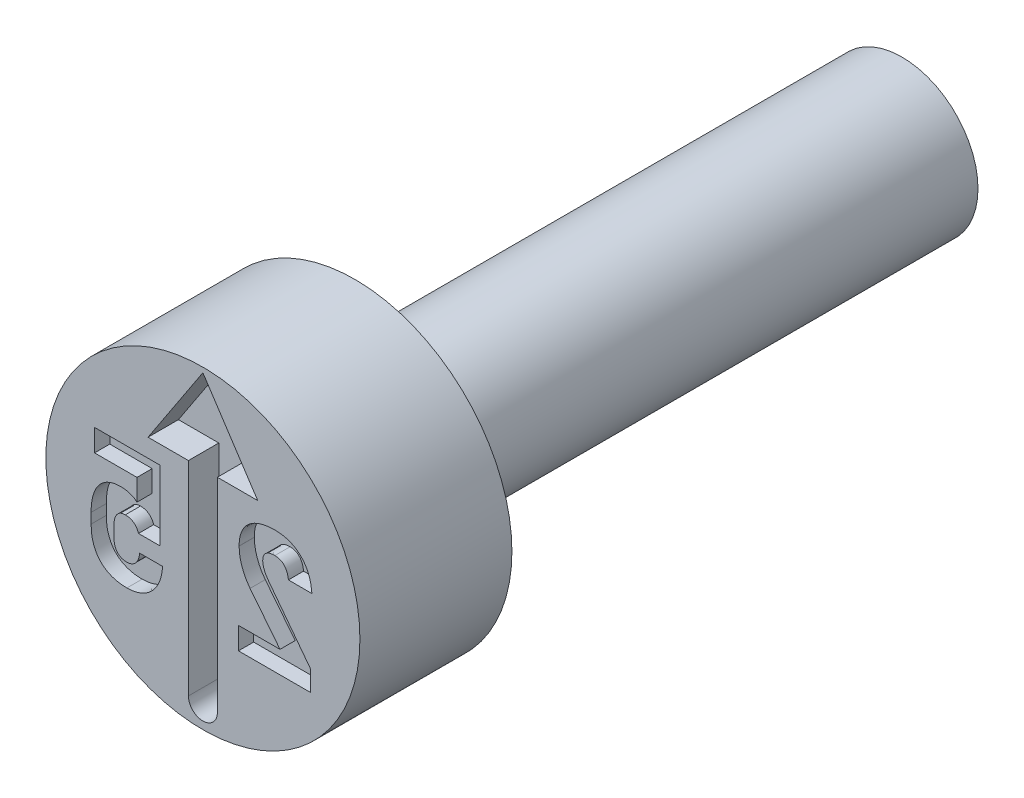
ISO-10303-21;
HEADER;
FILE_DESCRIPTION(('STEP AP214'),'2;1');
FILE_NAME('part.step','',(''),(''),'','','');
FILE_SCHEMA(('AUTOMOTIVE_DESIGN { 1 0 10303 214 1 1 1 1 }'));
ENDSEC;
DATA;
#1=APPLICATION_CONTEXT('core data for automotive mechanical design processes');
#2=APPLICATION_PROTOCOL_DEFINITION('international standard','automotive_design',2000,#1);
#3=PRODUCT_CONTEXT('',#1,'mechanical');
#4=PRODUCT('Part','Part','',(#3));
#5=PRODUCT_RELATED_PRODUCT_CATEGORY('part','',(#4));
#6=PRODUCT_DEFINITION_FORMATION('','',#4);
#7=PRODUCT_DEFINITION_CONTEXT('part definition',#1,'design');
#8=PRODUCT_DEFINITION('design','',#6,#7);
#9=PRODUCT_DEFINITION_SHAPE('','',#8);
#10=(LENGTH_UNIT() NAMED_UNIT(*) SI_UNIT(.MILLI.,.METRE.));
#11=(NAMED_UNIT(*) PLANE_ANGLE_UNIT() SI_UNIT($,.RADIAN.));
#12=(NAMED_UNIT(*) SI_UNIT($,.STERADIAN.) SOLID_ANGLE_UNIT());
#13=UNCERTAINTY_MEASURE_WITH_UNIT(LENGTH_MEASURE(1.E-05),#10,'distance_accuracy_value','');
#14=(GEOMETRIC_REPRESENTATION_CONTEXT(3) GLOBAL_UNCERTAINTY_ASSIGNED_CONTEXT((#13)) GLOBAL_UNIT_ASSIGNED_CONTEXT((#10,
#11,#12)) REPRESENTATION_CONTEXT('',''));
#15=CARTESIAN_POINT('',(0.,0.,0.));
#16=DIRECTION('',(0.,0.,1.));
#17=DIRECTION('',(1.,0.,0.));
#18=AXIS2_PLACEMENT_3D('',#15,#16,#17);
#19=CARTESIAN_POINT('',(0.,1.5,-3.));
#20=DIRECTION('',(0.,0.,1.));
#21=DIRECTION('',(1.,0.,0.));
#22=AXIS2_PLACEMENT_3D('',#19,#20,#21);
#23=PLANE('',#22);
#24=CARTESIAN_POINT('',(0.,0.,-3.));
#25=DIRECTION('',(0.,0.,1.));
#26=DIRECTION('',(1.,0.,0.));
#27=AXIS2_PLACEMENT_3D('',#24,#25,#26);
#28=CIRCLE('',#27,3.1);
#29=CARTESIAN_POINT('',(3.1,0.,-3.));
#30=VERTEX_POINT('',#29);
#31=EDGE_CURVE('E11',#30,#30,#28,.T.);
#32=ORIENTED_EDGE('',*,*,#31,.F.);
#33=EDGE_LOOP('',(#32));
#34=FACE_BOUND('',#33,.T.);
#35=CARTESIAN_POINT('',(0.,0.,-3.));
#36=DIRECTION('',(0.,0.,1.));
#37=DIRECTION('',(1.,0.,0.));
#38=AXIS2_PLACEMENT_3D('',#35,#36,#37);
#39=CIRCLE('',#38,1.5);
#40=CARTESIAN_POINT('',(1.5,0.,-3.));
#41=VERTEX_POINT('',#40);
#42=EDGE_CURVE('E562',#41,#41,#39,.T.);
#43=ORIENTED_EDGE('',*,*,#42,.T.);
#44=EDGE_LOOP('',(#43));
#45=FACE_BOUND('',#44,.T.);
#46=ADVANCED_FACE('F34',(#34,#45),#23,.F.);
#47=CARTESIAN_POINT('',(0.,0.,-0.403888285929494));
#48=DIRECTION('',(0.,0.,1.));
#49=DIRECTION('',(1.,0.,0.));
#50=AXIS2_PLACEMENT_3D('',#47,#48,#49);
#51=CYLINDRICAL_SURFACE('',#50,3.1);
#52=CARTESIAN_POINT('',(0.,0.,0.));
#53=DIRECTION('',(0.,0.,1.));
#54=DIRECTION('',(1.,0.,0.));
#55=AXIS2_PLACEMENT_3D('',#52,#53,#54);
#56=CIRCLE('',#55,3.1);
#57=CARTESIAN_POINT('',(3.1,0.,0.));
#58=VERTEX_POINT('',#57);
#59=EDGE_CURVE('E41',#58,#58,#56,.T.);
#60=ORIENTED_EDGE('',*,*,#59,.F.);
#61=EDGE_LOOP('',(#60));
#62=FACE_BOUND('',#61,.T.);
#63=ORIENTED_EDGE('',*,*,#31,.T.);
#64=EDGE_LOOP('',(#63));
#65=FACE_BOUND('',#64,.T.);
#66=ADVANCED_FACE('F584',(#62,#65),#51,.T.);
#67=CARTESIAN_POINT('',(0.,3.1,0.));
#68=DIRECTION('',(0.,0.,-1.));
#69=DIRECTION('',(-1.,0.,0.));
#70=AXIS2_PLACEMENT_3D('',#67,#68,#69);
#71=PLANE('',#70);
#72=CARTESIAN_POINT('',(-1.49909190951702,-1.42494395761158,0.));
#73=CARTESIAN_POINT('',(-1.46754873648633,-1.42398162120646,0.));
#74=CARTESIAN_POINT('',(-1.40582416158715,-1.42209849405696,0.));
#75=CARTESIAN_POINT('',(-1.31585167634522,-1.40519320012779,0.));
#76=CARTESIAN_POINT('',(-1.23055483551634,-1.37901229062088,0.));
#77=CARTESIAN_POINT('',(-1.15056790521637,-1.34166343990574,0.));
#78=CARTESIAN_POINT('',(-1.07676002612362,-1.29421283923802,0.));
#79=CARTESIAN_POINT('',(-1.01076293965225,-1.23618893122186,0.));
#80=CARTESIAN_POINT('',(-0.951971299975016,-1.16911088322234,0.));
#81=CARTESIAN_POINT('',(-0.901564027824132,-1.09239151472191,0.));
#82=CARTESIAN_POINT('',(-0.860051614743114,-1.00685156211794,0.));
#83=CARTESIAN_POINT('',(-0.827733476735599,-0.913499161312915,0.));
#84=CARTESIAN_POINT('',(-0.805536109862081,-0.812502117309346,0.));
#85=CARTESIAN_POINT('',(-0.799082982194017,-0.742432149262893,0.));
#86=CARTESIAN_POINT('',(-0.795770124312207,-0.706460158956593,0.));
#87=B_SPLINE_CURVE_WITH_KNOTS('',3,(#72,#73,#74,#75,#76,#77,#78,#79,#80,#81,#82,#83,#84,#85,
#86),.UNSPECIFIED.,.F.,.F.,(4,1,1,1,1,1,1,1,1,1,1,1,4),(0.,0.0844304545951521,0.165215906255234,
0.244369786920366,0.322918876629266,0.400936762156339,0.478631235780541,0.557558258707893,
0.639203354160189,0.723781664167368,0.811629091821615,0.903295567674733,1.),.UNSPECIFIED.);
#88=CARTESIAN_POINT('',(-1.49909190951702,-1.42494395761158,0.));
#89=VERTEX_POINT('',#88);
#90=CARTESIAN_POINT('',(-0.795770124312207,-0.706460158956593,0.));
#91=VERTEX_POINT('',#90);
#92=EDGE_CURVE('E856',#89,#91,#87,.T.);
#93=ORIENTED_EDGE('',*,*,#92,.F.);
#94=CARTESIAN_POINT('',(-2.20681556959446,-0.688363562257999,0.));
#95=CARTESIAN_POINT('',(-2.20574416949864,-0.725742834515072,0.));
#96=CARTESIAN_POINT('',(-2.20367151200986,-0.79805422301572,0.));
#97=CARTESIAN_POINT('',(-2.18884983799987,-0.902621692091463,0.));
#98=CARTESIAN_POINT('',(-2.16213055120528,-0.998540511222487,0.));
#99=CARTESIAN_POINT('',(-2.12633064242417,-1.08643080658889,0.));
#100=CARTESIAN_POINT('',(-2.07958342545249,-1.16454604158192,0.));
#101=CARTESIAN_POINT('',(-2.02360640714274,-1.23354608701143,0.));
#102=CARTESIAN_POINT('',(-1.95737806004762,-1.29183781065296,0.));
#103=CARTESIAN_POINT('',(-1.8824614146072,-1.34089522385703,0.));
#104=CARTESIAN_POINT('',(-1.79814363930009,-1.37851884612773,0.));
#105=CARTESIAN_POINT('',(-1.70577213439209,-1.405851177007,0.));
#106=CARTESIAN_POINT('',(-1.60498135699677,-1.42210857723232,0.));
#107=CARTESIAN_POINT('',(-1.53518336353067,-1.42397754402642,0.));
#108=CARTESIAN_POINT('',(-1.49909190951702,-1.42494395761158,0.));
#109=B_SPLINE_CURVE_WITH_KNOTS('',3,(#94,#95,#96,#97,#98,#99,#100,#101,#102,#103,#104,#105,#106,
#107,#108),.UNSPECIFIED.,.F.,.F.,(4,1,1,1,1,1,1,1,1,1,1,1,4),(0.,0.096591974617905,
0.1868602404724,0.272108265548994,0.353324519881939,0.431359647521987,0.506505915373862,
0.582010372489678,0.6584354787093,0.737063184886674,0.819709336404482,0.906774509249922,1.),.UNSPECIFIED.);
#110=CARTESIAN_POINT('',(-2.20681556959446,-0.688363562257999,0.));
#111=VERTEX_POINT('',#110);
#112=EDGE_CURVE('E48',#111,#89,#109,.T.);
#113=ORIENTED_EDGE('',*,*,#112,.F.);
#114=DIRECTION('',(0.,-1.,0.));
#115=VECTOR('',#114,1.);
#116=CARTESIAN_POINT('',(-2.20681556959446,-0.487344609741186,0.));
#117=LINE('',#116,#115);
#118=CARTESIAN_POINT('',(-2.20681556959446,-0.487344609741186,0.));
#119=VERTEX_POINT('',#118);
#120=EDGE_CURVE('E329',#119,#111,#117,.T.);
#121=ORIENTED_EDGE('',*,*,#120,.F.);
#122=CARTESIAN_POINT('',(-1.61598614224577,0.24727939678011,0.));
#123=CARTESIAN_POINT('',(-1.64606492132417,0.246327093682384,0.));
#124=CARTESIAN_POINT('',(-1.70440217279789,0.244480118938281,0.));
#125=CARTESIAN_POINT('',(-1.78854890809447,0.227866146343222,0.));
#126=CARTESIAN_POINT('',(-1.86609794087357,0.201248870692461,0.));
#127=CARTESIAN_POINT('',(-1.93640936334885,0.16290108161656,0.));
#128=CARTESIAN_POINT('',(-1.99956270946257,0.114837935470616,0.));
#129=CARTESIAN_POINT('',(-2.05441615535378,0.0561086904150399,0.));
#130=CARTESIAN_POINT('',(-2.10131165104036,-0.0123293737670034,0.));
#131=CARTESIAN_POINT('',(-2.13969159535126,-0.0905220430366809,0.));
#132=CARTESIAN_POINT('',(-2.16989822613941,-0.177784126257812,0.));
#133=CARTESIAN_POINT('',(-2.19183820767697,-0.273506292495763,0.));
#134=CARTESIAN_POINT('',(-2.20434129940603,-0.377781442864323,0.));
#135=CARTESIAN_POINT('',(-2.20597167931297,-0.449976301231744,0.));
#136=CARTESIAN_POINT('',(-2.20681556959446,-0.487344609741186,0.));
#137=B_SPLINE_CURVE_WITH_KNOTS('',3,(#122,#123,#124,#125,#126,#127,#128,#129,#130,#131,#132,
#133,#134,#135,#136),.UNSPECIFIED.,.F.,.F.,(4,1,1,1,1,1,1,1,1,1,1,1,4),(0.,0.084394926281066,
0.163682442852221,0.239848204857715,0.313806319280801,0.387615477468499,0.461788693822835,
0.538496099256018,0.61978489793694,0.70565234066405,0.797279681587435,0.895071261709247,1.),.UNSPECIFIED.);
#138=CARTESIAN_POINT('',(-1.61598614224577,0.24727939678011,0.));
#139=VERTEX_POINT('',#138);
#140=EDGE_CURVE('E332',#139,#119,#137,.T.);
#141=ORIENTED_EDGE('',*,*,#140,.F.);
#142=CARTESIAN_POINT('',(-1.30100754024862,0.140167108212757,0.));
#143=CARTESIAN_POINT('',(-1.31011315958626,0.148229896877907,0.));
#144=CARTESIAN_POINT('',(-1.32884412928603,0.164815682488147,0.));
#145=CARTESIAN_POINT('',(-1.36159125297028,0.185875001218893,0.));
#146=CARTESIAN_POINT('',(-1.39904391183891,0.203761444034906,0.));
#147=CARTESIAN_POINT('',(-1.45430878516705,0.22436176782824,0.));
#148=CARTESIAN_POINT('',(-1.52700733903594,0.242680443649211,0.));
#149=CARTESIAN_POINT('',(-1.58668776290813,0.245765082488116,0.));
#150=CARTESIAN_POINT('',(-1.61598614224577,0.24727939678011,0.));
#151=B_SPLINE_CURVE_WITH_KNOTS('',3,(#142,#143,#144,#145,#146,#147,#148,#149,#150),
.UNSPECIFIED.,.F.,.F.,(4,1,1,1,1,1,4),(0.,0.10729164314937,0.220707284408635,0.342410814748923,
0.473179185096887,0.741372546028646,1.),.UNSPECIFIED.);
#152=CARTESIAN_POINT('',(-1.30100754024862,0.140167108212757,0.));
#153=VERTEX_POINT('',#152);
#154=EDGE_CURVE('E783',#153,#139,#151,.T.);
#155=ORIENTED_EDGE('',*,*,#154,.F.);
#156=DIRECTION('',(0.,-1.,0.));
#157=VECTOR('',#156,1.);
#158=CARTESIAN_POINT('',(-1.30100754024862,0.564214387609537,0.));
#159=LINE('',#158,#157);
#160=CARTESIAN_POINT('',(-1.30100754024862,0.564214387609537,0.));
#161=VERTEX_POINT('',#160);
#162=EDGE_CURVE('E791',#161,#153,#159,.T.);
#163=ORIENTED_EDGE('',*,*,#162,.F.);
#164=DIRECTION('',(1.,0.,0.));
#165=VECTOR('',#164,1.);
#166=CARTESIAN_POINT('',(-2.13785286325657,0.564214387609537,0.));
#167=LINE('',#166,#165);
#168=CARTESIAN_POINT('',(-2.13785286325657,0.564214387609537,0.));
#169=VERTEX_POINT('',#168);
#170=EDGE_CURVE('E797',#169,#161,#167,.T.);
#171=ORIENTED_EDGE('',*,*,#170,.F.);
#172=DIRECTION('',(0.,-1.,0.));
#173=VECTOR('',#172,1.);
#174=CARTESIAN_POINT('',(-2.13785286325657,1.,0.));
#175=LINE('',#174,#173);
#176=CARTESIAN_POINT('',(-2.13785286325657,1.,0.));
#177=VERTEX_POINT('',#176);
#178=EDGE_CURVE('E800',#177,#169,#175,.T.);
#179=ORIENTED_EDGE('',*,*,#178,.F.);
#180=DIRECTION('',(-1.,0.,0.));
#181=VECTOR('',#180,1.);
#182=CARTESIAN_POINT('',(-0.848592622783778,1.,0.));
#183=LINE('',#182,#181);
#184=CARTESIAN_POINT('',(-0.848592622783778,1.,0.));
#185=VERTEX_POINT('',#184);
#186=EDGE_CURVE('E803',#185,#177,#183,.T.);
#187=ORIENTED_EDGE('',*,*,#186,.F.);
#188=DIRECTION('',(0.,1.,0.));
#189=VECTOR('',#188,1.);
#190=CARTESIAN_POINT('',(-0.848592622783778,-0.379743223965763,0.));
#191=LINE('',#190,#189);
#192=CARTESIAN_POINT('',(-0.848592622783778,-0.379743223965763,0.));
#193=VERTEX_POINT('',#192);
#194=EDGE_CURVE('E806',#193,#185,#191,.T.);
#195=ORIENTED_EDGE('',*,*,#194,.F.);
#196=DIRECTION('',(1.,0.,0.));
#197=VECTOR('',#196,1.);
#198=CARTESIAN_POINT('',(-1.27117261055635,-0.379743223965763,0.));
#199=LINE('',#198,#197);
#200=CARTESIAN_POINT('',(-1.27117261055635,-0.379743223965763,0.));
#201=VERTEX_POINT('',#200);
#202=EDGE_CURVE('E809',#201,#193,#199,.T.);
#203=ORIENTED_EDGE('',*,*,#202,.F.);
#204=CARTESIAN_POINT('',(-1.53186142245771,-0.191440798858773,0.));
#205=CARTESIAN_POINT('',(-1.51615900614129,-0.191919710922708,0.));
#206=CARTESIAN_POINT('',(-1.48575970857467,-0.192846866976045,0.));
#207=CARTESIAN_POINT('',(-1.44198947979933,-0.202447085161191,0.));
#208=CARTESIAN_POINT('',(-1.40176032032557,-0.218154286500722,0.));
#209=CARTESIAN_POINT('',(-1.36552890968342,-0.240361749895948,0.));
#210=CARTESIAN_POINT('',(-1.33352866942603,-0.267579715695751,0.));
#211=CARTESIAN_POINT('',(-1.30718243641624,-0.300467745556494,0.));
#212=CARTESIAN_POINT('',(-1.28509676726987,-0.337629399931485,0.));
#213=CARTESIAN_POINT('',(-1.27588143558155,-0.365501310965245,0.));
#214=CARTESIAN_POINT('',(-1.27117261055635,-0.379743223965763,0.));
#215=B_SPLINE_CURVE_WITH_KNOTS('',3,(#204,#205,#206,#207,#208,#209,#210,#211,#212,#213,#214),
.UNSPECIFIED.,.F.,.F.,(4,1,1,1,1,1,1,1,4),(0.,0.135635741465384,0.262585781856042,
0.385395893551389,0.507524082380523,0.628507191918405,0.746772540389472,0.870606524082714,1.),.UNSPECIFIED.);
#216=CARTESIAN_POINT('',(-1.53186142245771,-0.191440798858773,0.));
#217=VERTEX_POINT('',#216);
#218=EDGE_CURVE('E812',#217,#201,#215,.T.);
#219=ORIENTED_EDGE('',*,*,#218,.F.);
#220=CARTESIAN_POINT('',(-1.75488974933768,-0.487344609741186,0.));
#221=CARTESIAN_POINT('',(-1.7544067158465,-0.464949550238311,0.));
#222=CARTESIAN_POINT('',(-1.75348998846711,-0.42244698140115,0.));
#223=CARTESIAN_POINT('',(-1.74208593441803,-0.362992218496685,0.));
#224=CARTESIAN_POINT('',(-1.72435488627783,-0.311119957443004,0.));
#225=CARTESIAN_POINT('',(-1.69816860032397,-0.268059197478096,0.));
#226=CARTESIAN_POINT('',(-1.66561635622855,-0.233302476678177,0.));
#227=CARTESIAN_POINT('',(-1.62622411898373,-0.20861691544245,0.));
#228=CARTESIAN_POINT('',(-1.58078309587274,-0.194037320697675,0.));
#229=CARTESIAN_POINT('',(-1.54860048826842,-0.192329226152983,0.));
#230=CARTESIAN_POINT('',(-1.53186142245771,-0.191440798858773,0.));
#231=B_SPLINE_CURVE_WITH_KNOTS('',3,(#220,#221,#222,#223,#224,#225,#226,#227,#228,#229,#230),
.UNSPECIFIED.,.F.,.F.,(4,1,1,1,1,1,1,1,4),(0.,0.160198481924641,0.304033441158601,
0.431843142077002,0.550810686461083,0.662316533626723,0.769888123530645,0.880312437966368,1.),.UNSPECIFIED.);
#232=CARTESIAN_POINT('',(-1.75488974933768,-0.487344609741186,0.));
#233=VERTEX_POINT('',#232);
#234=EDGE_CURVE('E817',#233,#217,#231,.T.);
#235=ORIENTED_EDGE('',*,*,#234,.F.);
#236=DIRECTION('',(0.,1.,0.));
#237=VECTOR('',#236,1.);
#238=CARTESIAN_POINT('',(-1.75488974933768,-0.688363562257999,0.));
#239=LINE('',#238,#237);
#240=CARTESIAN_POINT('',(-1.75488974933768,-0.688363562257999,0.));
#241=VERTEX_POINT('',#240);
#242=EDGE_CURVE('E825',#241,#233,#239,.T.);
#243=ORIENTED_EDGE('',*,*,#242,.F.);
#244=CARTESIAN_POINT('',(-1.50545017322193,-0.985734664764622,0.));
#245=CARTESIAN_POINT('',(-1.52431335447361,-0.984912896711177,0.));
#246=CARTESIAN_POINT('',(-1.56039373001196,-0.983341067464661,0.));
#247=CARTESIAN_POINT('',(-1.6109663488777,-0.968170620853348,0.));
#248=CARTESIAN_POINT('',(-1.65499172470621,-0.943882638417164,0.));
#249=CARTESIAN_POINT('',(-1.69135675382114,-0.908933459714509,0.));
#250=CARTESIAN_POINT('',(-1.72036678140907,-0.865387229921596,0.));
#251=CARTESIAN_POINT('',(-1.74090174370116,-0.813240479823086,0.));
#252=CARTESIAN_POINT('',(-1.75306320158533,-0.753320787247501,0.));
#253=CARTESIAN_POINT('',(-1.75425997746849,-0.710760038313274,0.));
#254=CARTESIAN_POINT('',(-1.75488974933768,-0.688363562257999,0.));
#255=B_SPLINE_CURVE_WITH_KNOTS('',3,(#244,#245,#246,#247,#248,#249,#250,#251,#252,#253,#254),
.UNSPECIFIED.,.F.,.F.,(4,1,1,1,1,1,1,1,4),(0.,0.128261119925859,0.245330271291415,
0.356275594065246,0.467886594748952,0.585607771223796,0.710231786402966,0.847517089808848,1.),.UNSPECIFIED.);
#256=CARTESIAN_POINT('',(-1.50545017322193,-0.985734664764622,0.));
#257=VERTEX_POINT('',#256);
#258=EDGE_CURVE('E831',#257,#241,#255,.T.);
#259=ORIENTED_EDGE('',*,*,#258,.F.);
#260=CARTESIAN_POINT('',(-1.24818504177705,-0.706460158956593,0.));
#261=CARTESIAN_POINT('',(-1.25076775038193,-0.727466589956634,0.));
#262=CARTESIAN_POINT('',(-1.25568972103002,-0.767499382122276,0.));
#263=CARTESIAN_POINT('',(-1.27343837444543,-0.823053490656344,0.));
#264=CARTESIAN_POINT('',(-1.29661038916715,-0.871885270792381,0.));
#265=CARTESIAN_POINT('',(-1.32721880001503,-0.912859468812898,0.));
#266=CARTESIAN_POINT('',(-1.36356643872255,-0.946124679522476,0.));
#267=CARTESIAN_POINT('',(-1.40663718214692,-0.968685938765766,0.));
#268=CARTESIAN_POINT('',(-1.45423908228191,-0.983740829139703,0.));
#269=CARTESIAN_POINT('',(-1.48804735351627,-0.985057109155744,0.));
#270=CARTESIAN_POINT('',(-1.50545017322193,-0.985734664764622,0.));
#271=B_SPLINE_CURVE_WITH_KNOTS('',3,(#260,#261,#262,#263,#264,#265,#266,#267,#268,#269,#270),
.UNSPECIFIED.,.F.,.F.,(4,1,1,1,1,1,1,1,4),(0.,0.150277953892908,0.286390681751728,
0.412971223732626,0.533144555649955,0.648163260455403,0.760273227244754,0.876600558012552,1.),.UNSPECIFIED.);
#272=CARTESIAN_POINT('',(-1.24818504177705,-0.706460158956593,0.));
#273=VERTEX_POINT('',#272);
#274=EDGE_CURVE('E836',#273,#257,#271,.T.);
#275=ORIENTED_EDGE('',*,*,#274,.F.);
#276=DIRECTION('',(0.,-1.,0.));
#277=VECTOR('',#276,1.);
#278=CARTESIAN_POINT('',(-1.24818504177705,-0.704992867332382,0.));
#279=LINE('',#278,#277);
#280=CARTESIAN_POINT('',(-1.24818504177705,-0.704992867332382,0.));
#281=VERTEX_POINT('',#280);
#282=EDGE_CURVE('E844',#281,#273,#279,.T.);
#283=ORIENTED_EDGE('',*,*,#282,.F.);
#284=DIRECTION('',(-1.,0.,0.));
#285=VECTOR('',#284,1.);
#286=CARTESIAN_POINT('',(-0.795770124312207,-0.704992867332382,0.));
#287=LINE('',#286,#285);
#288=CARTESIAN_POINT('',(-0.795770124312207,-0.704992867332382,0.));
#289=VERTEX_POINT('',#288);
#290=EDGE_CURVE('E850',#289,#281,#287,.T.);
#291=ORIENTED_EDGE('',*,*,#290,.F.);
#292=DIRECTION('',(0.,1.,0.));
#293=VECTOR('',#292,1.);
#294=CARTESIAN_POINT('',(-0.795770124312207,-0.706460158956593,0.));
#295=LINE('',#294,#293);
#296=EDGE_CURVE('E853',#91,#289,#295,.T.);
#297=ORIENTED_EDGE('',*,*,#296,.F.);
#298=EDGE_LOOP('',(#93,#113,#121,#141,#155,#163,#171,#179,#187,#195,#203,#219,#235,#243,#259,
#275,#283,#291,#297));
#299=FACE_BOUND('',#298,.T.);
#300=DIRECTION('',(-0.60539313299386,0.795926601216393,0.));
#301=VECTOR('',#300,1.);
#302=CARTESIAN_POINT('',(2.12147951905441,-0.992092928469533,0.));
#303=LINE('',#302,#301);
#304=CARTESIAN_POINT('',(2.12147951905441,-0.992092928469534,0.));
#305=VERTEX_POINT('',#304);
#306=CARTESIAN_POINT('',(1.29783982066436,0.0907682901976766,0.));
#307=VERTEX_POINT('',#306);
#308=EDGE_CURVE('E405',#305,#307,#303,.T.);
#309=ORIENTED_EDGE('',*,*,#308,.F.);
#310=DIRECTION('',(0.,1.,0.));
#311=VECTOR('',#310,1.);
#312=CARTESIAN_POINT('',(2.12147951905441,-1.4,0.));
#313=LINE('',#312,#311);
#314=CARTESIAN_POINT('',(2.12147951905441,-1.4,0.));
#315=VERTEX_POINT('',#314);
#316=EDGE_CURVE('E56',#315,#305,#313,.T.);
#317=ORIENTED_EDGE('',*,*,#316,.F.);
#318=DIRECTION('',(1.,0.,0.));
#319=VECTOR('',#318,1.);
#320=CARTESIAN_POINT('',(0.702119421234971,-1.4,0.));
#321=LINE('',#320,#319);
#322=CARTESIAN_POINT('',(0.702119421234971,-1.4,0.));
#323=VERTEX_POINT('',#322);
#324=EDGE_CURVE('E481',#323,#315,#321,.T.);
#325=ORIENTED_EDGE('',*,*,#324,.F.);
#326=DIRECTION('',(0.,-1.,0.));
#327=VECTOR('',#326,1.);
#328=CARTESIAN_POINT('',(0.702119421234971,-0.964214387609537,0.));
#329=LINE('',#328,#327);
#330=CARTESIAN_POINT('',(0.702119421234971,-0.964214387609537,0.));
#331=VERTEX_POINT('',#330);
#332=EDGE_CURVE('E478',#331,#323,#329,.T.);
#333=ORIENTED_EDGE('',*,*,#332,.F.);
#334=DIRECTION('',(-1.,0.,0.));
#335=VECTOR('',#334,1.);
#336=CARTESIAN_POINT('',(1.52233543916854,-0.964214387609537,0.));
#337=LINE('',#336,#335);
#338=CARTESIAN_POINT('',(1.52233543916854,-0.964214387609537,0.));
#339=VERTEX_POINT('',#338);
#340=EDGE_CURVE('E475',#339,#331,#337,.T.);
#341=ORIENTED_EDGE('',*,*,#340,.F.);
#342=DIRECTION('',(0.620676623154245,-0.78406666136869,0.));
#343=VECTOR('',#342,1.);
#344=CARTESIAN_POINT('',(0.93150601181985,-0.217852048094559,0.));
#345=LINE('',#344,#343);
#346=CARTESIAN_POINT('',(0.93150601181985,-0.217852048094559,0.));
#347=VERTEX_POINT('',#346);
#348=EDGE_CURVE('E469',#347,#339,#345,.T.);
#349=ORIENTED_EDGE('',*,*,#348,.F.);
#350=CARTESIAN_POINT('',(0.715325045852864,0.397432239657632,0.));
#351=CARTESIAN_POINT('',(0.715952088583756,0.370171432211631,0.));
#352=CARTESIAN_POINT('',(0.717207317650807,0.315600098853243,0.));
#353=CARTESIAN_POINT('',(0.72840233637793,0.234072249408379,0.));
#354=CARTESIAN_POINT('',(0.74670785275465,0.15301545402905,0.));
#355=CARTESIAN_POINT('',(0.771545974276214,0.0727137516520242,0.));
#356=CARTESIAN_POINT('',(0.802561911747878,-0.00549198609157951,0.));
#357=CARTESIAN_POINT('',(0.839577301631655,-0.0803555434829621,0.));
#358=CARTESIAN_POINT('',(0.881837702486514,-0.151685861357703,0.));
#359=CARTESIAN_POINT('',(0.914952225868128,-0.195799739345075,0.));
#360=CARTESIAN_POINT('',(0.93150601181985,-0.217852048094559,0.));
#361=B_SPLINE_CURVE_WITH_KNOTS('',3,(#350,#351,#352,#353,#354,#355,#356,#357,#358,#359,#360),
.UNSPECIFIED.,.F.,.F.,(4,1,1,1,1,1,1,1,4),(0.,0.123148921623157,0.24652244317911,
0.371108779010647,0.498350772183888,0.625999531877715,0.750879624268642,0.875465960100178,1.),.UNSPECIFIED.);
#362=CARTESIAN_POINT('',(0.715325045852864,0.397432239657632,0.));
#363=VERTEX_POINT('',#362);
#364=EDGE_CURVE('E464',#363,#347,#361,.T.);
#365=ORIENTED_EDGE('',*,*,#364,.F.);
#366=DIRECTION('',(0.,-1.,0.));
#367=VECTOR('',#366,1.);
#368=CARTESIAN_POINT('',(0.715325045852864,0.399388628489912,0.));
#369=LINE('',#368,#367);
#370=CARTESIAN_POINT('',(0.715325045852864,0.399388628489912,0.));
#371=VERTEX_POINT('',#370);
#372=EDGE_CURVE('E458',#371,#363,#369,.T.);
#373=ORIENTED_EDGE('',*,*,#372,.F.);
#374=CARTESIAN_POINT('',(1.42500509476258,1.02494395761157,0.));
#375=CARTESIAN_POINT('',(1.38893003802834,1.02418979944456,0.));
#376=CARTESIAN_POINT('',(1.31910896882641,1.02273017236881,0.));
#377=CARTESIAN_POINT('',(1.218571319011,1.00898945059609,0.));
#378=CARTESIAN_POINT('',(1.12612521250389,0.986123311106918,0.));
#379=CARTESIAN_POINT('',(1.04200257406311,0.953997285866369,0.));
#380=CARTESIAN_POINT('',(0.966755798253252,0.912700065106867,0.));
#381=CARTESIAN_POINT('',(0.900036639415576,0.863680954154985,0.));
#382=CARTESIAN_POINT('',(0.843728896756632,0.805037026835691,0.));
#383=CARTESIAN_POINT('',(0.796891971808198,0.738416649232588,0.));
#384=CARTESIAN_POINT('',(0.759970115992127,0.664076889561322,0.));
#385=CARTESIAN_POINT('',(0.734113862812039,0.582081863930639,0.));
#386=CARTESIAN_POINT('',(0.71827932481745,0.493090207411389,0.));
#387=CARTESIAN_POINT('',(0.716329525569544,0.431247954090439,0.));
#388=CARTESIAN_POINT('',(0.715325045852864,0.399388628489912,0.));
#389=B_SPLINE_CURVE_WITH_KNOTS('',3,(#374,#375,#376,#377,#378,#379,#380,#381,#382,#383,#384,
#385,#386,#387,#388),.UNSPECIFIED.,.F.,.F.,(4,1,1,1,1,1,1,1,1,1,1,1,4),(0.,0.100715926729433,
0.194929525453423,0.2827284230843,0.366191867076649,0.44566981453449,0.521804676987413,
0.596515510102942,0.671682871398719,0.748455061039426,0.827368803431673,0.911065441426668,1.),.UNSPECIFIED.);
#390=CARTESIAN_POINT('',(1.42500509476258,1.02494395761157,0.));
#391=VERTEX_POINT('',#390);
#392=EDGE_CURVE('E450',#391,#371,#389,.T.);
#393=ORIENTED_EDGE('',*,*,#392,.F.);
#394=CARTESIAN_POINT('',(2.15131444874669,0.306949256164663,0.));
#395=CARTESIAN_POINT('',(2.14799224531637,0.343080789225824,0.));
#396=CARTESIAN_POINT('',(2.14152039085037,0.41346721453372,0.));
#397=CARTESIAN_POINT('',(2.11951425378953,0.51468853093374,0.));
#398=CARTESIAN_POINT('',(2.08700480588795,0.607827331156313,0.));
#399=CARTESIAN_POINT('',(2.0454694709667,0.693140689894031,0.));
#400=CARTESIAN_POINT('',(1.99453990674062,0.769551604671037,0.));
#401=CARTESIAN_POINT('',(1.93544645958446,0.837039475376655,0.));
#402=CARTESIAN_POINT('',(1.86753463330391,0.894293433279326,0.));
#403=CARTESIAN_POINT('',(1.79198075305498,0.941869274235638,0.));
#404=CARTESIAN_POINT('',(1.70911482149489,0.979102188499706,0.));
#405=CARTESIAN_POINT('',(1.61995024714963,1.00623041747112,0.));
#406=CARTESIAN_POINT('',(1.52435273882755,1.02186953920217,0.));
#407=CARTESIAN_POINT('',(1.45864673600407,1.02390288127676,0.));
#408=CARTESIAN_POINT('',(1.42500509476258,1.02494395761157,0.));
#409=B_SPLINE_CURVE_WITH_KNOTS('',3,(#394,#395,#396,#397,#398,#399,#400,#401,#402,#403,#404,
#405,#406,#407,#408),.UNSPECIFIED.,.F.,.F.,(4,1,1,1,1,1,1,1,1,1,1,1,4),(0.,0.0953291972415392,
0.185707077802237,0.271513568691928,0.354131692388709,0.434493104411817,0.512233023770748,
0.58917600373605,0.667186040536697,0.746219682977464,0.827302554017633,0.911578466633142,1.),.UNSPECIFIED.);
#410=CARTESIAN_POINT('',(2.15131444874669,0.306949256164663,0.));
#411=VERTEX_POINT('',#410);
#412=EDGE_CURVE('E445',#411,#391,#409,.T.);
#413=ORIENTED_EDGE('',*,*,#412,.F.);
#414=DIRECTION('',(0.,1.,0.));
#415=VECTOR('',#414,1.);
#416=CARTESIAN_POINT('',(2.15131444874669,0.304992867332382,0.));
#417=LINE('',#416,#415);
#418=CARTESIAN_POINT('',(2.15131444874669,0.304992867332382,0.));
#419=VERTEX_POINT('',#418);
#420=EDGE_CURVE('E442',#419,#411,#417,.T.);
#421=ORIENTED_EDGE('',*,*,#420,.F.);
#422=DIRECTION('',(1.,0.,0.));
#423=VECTOR('',#422,1.);
#424=CARTESIAN_POINT('',(1.68765029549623,0.304992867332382,0.));
#425=LINE('',#424,#423);
#426=CARTESIAN_POINT('',(1.68765029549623,0.304992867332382,0.));
#427=VERTEX_POINT('',#426);
#428=EDGE_CURVE('E439',#427,#419,#425,.T.);
#429=ORIENTED_EDGE('',*,*,#428,.F.);
#430=DIRECTION('',(0.,-1.,0.));
#431=VECTOR('',#430,1.);
#432=CARTESIAN_POINT('',(1.68765029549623,0.306949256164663,0.));
#433=LINE('',#432,#431);
#434=CARTESIAN_POINT('',(1.68765029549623,0.306949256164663,0.));
#435=VERTEX_POINT('',#434);
#436=EDGE_CURVE('E433',#435,#427,#433,.T.);
#437=ORIENTED_EDGE('',*,*,#436,.F.);
#438=CARTESIAN_POINT('',(1.42158141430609,0.589158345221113,0.));
#439=CARTESIAN_POINT('',(1.43944270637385,0.588403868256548,0.));
#440=CARTESIAN_POINT('',(1.4741058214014,0.586939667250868,0.));
#441=CARTESIAN_POINT('',(1.52341435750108,0.572987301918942,0.));
#442=CARTESIAN_POINT('',(1.56721680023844,0.549300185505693,0.));
#443=CARTESIAN_POINT('',(1.60513490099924,0.516564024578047,0.));
#444=CARTESIAN_POINT('',(1.63695162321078,0.475381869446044,0.));
#445=CARTESIAN_POINT('',(1.66040291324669,0.425770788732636,0.));
#446=CARTESIAN_POINT('',(1.67928862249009,0.369385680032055,0.));
#447=CARTESIAN_POINT('',(1.68476922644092,0.328462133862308,0.));
#448=CARTESIAN_POINT('',(1.68765029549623,0.306949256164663,0.));
#449=B_SPLINE_CURVE_WITH_KNOTS('',3,(#438,#439,#440,#441,#442,#443,#444,#445,#446,#447,#448),
.UNSPECIFIED.,.F.,.F.,(4,1,1,1,1,1,1,1,4),(0.,0.124212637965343,0.241057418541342,
0.353359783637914,0.468536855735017,0.587568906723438,0.713021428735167,0.849139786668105,1.),.UNSPECIFIED.);
#450=CARTESIAN_POINT('',(1.42158141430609,0.589158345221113,0.));
#451=VERTEX_POINT('',#450);
#452=EDGE_CURVE('E425',#451,#435,#449,.T.);
#453=ORIENTED_EDGE('',*,*,#452,.F.);
#454=CARTESIAN_POINT('',(1.1809455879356,0.386183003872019,0.));
#455=CARTESIAN_POINT('',(1.18160196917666,0.401594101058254,0.));
#456=CARTESIAN_POINT('',(1.18285281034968,0.430962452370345,0.));
#457=CARTESIAN_POINT('',(1.19492854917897,0.472280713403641,0.));
#458=CARTESIAN_POINT('',(1.21489703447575,0.508009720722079,0.));
#459=CARTESIAN_POINT('',(1.24286746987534,0.537960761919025,0.));
#460=CARTESIAN_POINT('',(1.27844603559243,0.560979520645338,0.));
#461=CARTESIAN_POINT('',(1.32041320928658,0.577794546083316,0.));
#462=CARTESIAN_POINT('',(1.36899201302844,0.587308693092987,0.));
#463=CARTESIAN_POINT('',(1.40344272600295,0.588520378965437,0.));
#464=CARTESIAN_POINT('',(1.42158141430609,0.589158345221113,0.));
#465=B_SPLINE_CURVE_WITH_KNOTS('',3,(#454,#455,#456,#457,#458,#459,#460,#461,#462,#463,#464),
.UNSPECIFIED.,.F.,.F.,(4,1,1,1,1,1,1,1,4),(0.,0.129170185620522,0.246154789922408,
0.35773418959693,0.470108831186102,0.586692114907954,0.710769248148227,0.847716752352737,1.),.UNSPECIFIED.);
#466=CARTESIAN_POINT('',(1.1809455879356,0.386183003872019,0.));
#467=VERTEX_POINT('',#466);
#468=EDGE_CURVE('E420',#467,#451,#465,.T.);
#469=ORIENTED_EDGE('',*,*,#468,.F.);
#470=DIRECTION('',(0.,1.,0.));
#471=VECTOR('',#470,1.);
#472=CARTESIAN_POINT('',(1.1809455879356,0.382759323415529,0.));
#473=LINE('',#472,#471);
#474=CARTESIAN_POINT('',(1.1809455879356,0.382759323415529,0.));
#475=VERTEX_POINT('',#474);
#476=EDGE_CURVE('E414',#475,#467,#473,.T.);
#477=ORIENTED_EDGE('',*,*,#476,.F.);
#478=CARTESIAN_POINT('',(1.29783982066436,0.0907682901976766,0.));
#479=CARTESIAN_POINT('',(1.28056586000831,0.114734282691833,0.));
#480=CARTESIAN_POINT('',(1.24684349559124,0.161520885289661,0.));
#481=CARTESIAN_POINT('',(1.21667240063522,0.226052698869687,0.));
#482=CARTESIAN_POINT('',(1.19750568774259,0.276652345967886,0.));
#483=CARTESIAN_POINT('',(1.18864451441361,0.313356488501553,0.));
#484=CARTESIAN_POINT('',(1.18208479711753,0.348453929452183,0.));
#485=CARTESIAN_POINT('',(1.18132010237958,0.371481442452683,0.));
#486=CARTESIAN_POINT('',(1.1809455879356,0.382759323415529,0.));
#487=B_SPLINE_CURVE_WITH_KNOTS('',3,(#478,#479,#480,#481,#482,#483,#484,#485,#486),
.UNSPECIFIED.,.F.,.F.,(4,1,1,1,1,1,4),(0.,0.27673722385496,0.540248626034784,0.665633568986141,
0.784034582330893,0.894229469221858,1.),.UNSPECIFIED.);
#488=EDGE_CURVE('E409',#307,#475,#487,.T.);
#489=ORIENTED_EDGE('',*,*,#488,.F.);
#490=EDGE_LOOP('',(#309,#317,#325,#333,#341,#349,#365,#373,#393,#413,#421,#429,#437,#453,#469,
#477,#489));
#491=FACE_BOUND('',#490,.T.);
#492=DIRECTION('',(0.,1.,0.));
#493=VECTOR('',#492,1.);
#494=CARTESIAN_POINT('',(0.28570968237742,1.35952714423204,0.));
#495=LINE('',#494,#493);
#496=CARTESIAN_POINT('',(0.285709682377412,-2.66424275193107,0.));
#497=VERTEX_POINT('',#496);
#498=CARTESIAN_POINT('',(0.28570968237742,1.35952714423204,0.));
#499=VERTEX_POINT('',#498);
#500=EDGE_CURVE('E543',#497,#499,#495,.T.);
#501=ORIENTED_EDGE('',*,*,#500,.F.);
#502=CARTESIAN_POINT('',(2.4513673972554E-13,-2.66424275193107,0.));
#503=DIRECTION('',(0.,0.,1.));
#504=DIRECTION('',(1.,0.,0.));
#505=AXIS2_PLACEMENT_3D('',#502,#503,#504);
#506=CIRCLE('',#505,0.285709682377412);
#507=CARTESIAN_POINT('',(-0.285709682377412,-2.66424275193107,0.));
#508=VERTEX_POINT('',#507);
#509=EDGE_CURVE('E487',#508,#497,#506,.T.);
#510=ORIENTED_EDGE('',*,*,#509,.F.);
#511=DIRECTION('',(0.,-1.,0.));
#512=VECTOR('',#511,1.);
#513=CARTESIAN_POINT('',(-0.28570968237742,1.35952714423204,0.));
#514=LINE('',#513,#512);
#515=CARTESIAN_POINT('',(-0.28570968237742,1.35952714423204,0.));
#516=VERTEX_POINT('',#515);
#517=EDGE_CURVE('E523',#516,#508,#514,.T.);
#518=ORIENTED_EDGE('',*,*,#517,.F.);
#519=DIRECTION('',(1.,0.,0.));
#520=VECTOR('',#519,1.);
#521=CARTESIAN_POINT('',(-1.08287651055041,1.35952714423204,0.));
#522=LINE('',#521,#520);
#523=CARTESIAN_POINT('',(-1.08287651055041,1.35952714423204,0.));
#524=VERTEX_POINT('',#523);
#525=EDGE_CURVE('E555',#524,#516,#522,.T.);
#526=ORIENTED_EDGE('',*,*,#525,.F.);
#527=DIRECTION('',(-0.550159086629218,-0.835059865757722,0.));
#528=VECTOR('',#527,1.);
#529=CARTESIAN_POINT('',(0.,3.00317301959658,0.));
#530=LINE('',#529,#528);
#531=CARTESIAN_POINT('',(0.,3.00317301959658,0.));
#532=VERTEX_POINT('',#531);
#533=EDGE_CURVE('E552',#532,#524,#530,.T.);
#534=ORIENTED_EDGE('',*,*,#533,.F.);
#535=DIRECTION('',(-0.550159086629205,0.835059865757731,0.));
#536=VECTOR('',#535,1.);
#537=CARTESIAN_POINT('',(0.,3.00317301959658,0.));
#538=LINE('',#537,#536);
#539=CARTESIAN_POINT('',(1.08287651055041,1.35952714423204,0.));
#540=VERTEX_POINT('',#539);
#541=EDGE_CURVE('E549',#540,#532,#538,.T.);
#542=ORIENTED_EDGE('',*,*,#541,.F.);
#543=DIRECTION('',(1.,0.,0.));
#544=VECTOR('',#543,1.);
#545=CARTESIAN_POINT('',(1.08287651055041,1.35952714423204,0.));
#546=LINE('',#545,#544);
#547=EDGE_CURVE('E546',#499,#540,#546,.T.);
#548=ORIENTED_EDGE('',*,*,#547,.F.);
#549=EDGE_LOOP('',(#501,#510,#518,#526,#534,#542,#548));
#550=FACE_BOUND('',#549,.T.);
#551=ORIENTED_EDGE('',*,*,#59,.T.);
#552=EDGE_LOOP('',(#551));
#553=FACE_BOUND('',#552,.T.);
#554=ADVANCED_FACE('F582',(#299,#491,#550,#553),#71,.F.);
#555=CARTESIAN_POINT('',(0.,0.,-13.8));
#556=DIRECTION('',(0.,0.,1.));
#557=DIRECTION('',(1.,0.,0.));
#558=AXIS2_PLACEMENT_3D('',#555,#556,#557);
#559=PLANE('',#558);
#560=CARTESIAN_POINT('',(0.,0.,-13.8));
#561=DIRECTION('',(0.,0.,1.));
#562=DIRECTION('',(1.,0.,0.));
#563=AXIS2_PLACEMENT_3D('',#560,#561,#562);
#564=CIRCLE('',#563,1.5);
#565=CARTESIAN_POINT('',(1.5,0.,-13.8));
#566=VERTEX_POINT('',#565);
#567=EDGE_CURVE('E577',#566,#566,#564,.T.);
#568=ORIENTED_EDGE('',*,*,#567,.F.);
#569=EDGE_LOOP('',(#568));
#570=FACE_BOUND('',#569,.T.);
#571=ADVANCED_FACE('F597',(#570),#559,.F.);
#572=CARTESIAN_POINT('',(0.,0.,-0.403888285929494));
#573=DIRECTION('',(0.,0.,1.));
#574=DIRECTION('',(1.,0.,0.));
#575=AXIS2_PLACEMENT_3D('',#572,#573,#574);
#576=CYLINDRICAL_SURFACE('',#575,1.5);
#577=ORIENTED_EDGE('',*,*,#42,.F.);
#578=EDGE_LOOP('',(#577));
#579=FACE_BOUND('',#578,.T.);
#580=ORIENTED_EDGE('',*,*,#567,.T.);
#581=EDGE_LOOP('',(#580));
#582=FACE_BOUND('',#581,.T.);
#583=ADVANCED_FACE('F593',(#579,#582),#576,.T.);
#584=CARTESIAN_POINT('',(2.4513673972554E-13,-2.66424275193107,-0.6));
#585=DIRECTION('',(0.,0.,1.));
#586=DIRECTION('',(1.,0.,0.));
#587=AXIS2_PLACEMENT_3D('',#584,#585,#586);
#588=CYLINDRICAL_SURFACE('',#587,0.285709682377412);
#589=ORIENTED_EDGE('',*,*,#509,.T.);
#590=DIRECTION('',(0.,0.,1.));
#591=VECTOR('',#590,1.);
#592=CARTESIAN_POINT('',(0.285709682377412,-2.66424275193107,-0.6));
#593=LINE('',#592,#591);
#594=CARTESIAN_POINT('',(0.285709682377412,-2.66424275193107,-0.6));
#595=VERTEX_POINT('',#594);
#596=EDGE_CURVE('E541',#595,#497,#593,.T.);
#597=ORIENTED_EDGE('',*,*,#596,.F.);
#598=CARTESIAN_POINT('',(2.4513673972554E-13,-2.66424275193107,-0.6));
#599=DIRECTION('',(0.,0.,1.));
#600=DIRECTION('',(1.,0.,0.));
#601=AXIS2_PLACEMENT_3D('',#598,#599,#600);
#602=CIRCLE('',#601,0.285709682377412);
#603=CARTESIAN_POINT('',(-0.285709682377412,-2.66424275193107,-0.6));
#604=VERTEX_POINT('',#603);
#605=EDGE_CURVE('E519',#604,#595,#602,.T.);
#606=ORIENTED_EDGE('',*,*,#605,.F.);
#607=DIRECTION('',(0.,0.,1.));
#608=VECTOR('',#607,1.);
#609=CARTESIAN_POINT('',(-0.285709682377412,-2.66424275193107,-0.6));
#610=LINE('',#609,#608);
#611=EDGE_CURVE('E560',#604,#508,#610,.T.);
#612=ORIENTED_EDGE('',*,*,#611,.T.);
#613=EDGE_LOOP('',(#589,#597,#606,#612));
#614=FACE_BOUND('',#613,.T.);
#615=ADVANCED_FACE('F596',(#614),#588,.F.);
#616=CARTESIAN_POINT('',(-0.28570968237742,1.35952714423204,-0.6));
#617=DIRECTION('',(-1.,0.,0.));
#618=DIRECTION('',(0.,-1.,0.));
#619=AXIS2_PLACEMENT_3D('',#616,#617,#618);
#620=PLANE('',#619);
#621=ORIENTED_EDGE('',*,*,#517,.T.);
#622=ORIENTED_EDGE('',*,*,#611,.F.);
#623=DIRECTION('',(0.,-1.,0.));
#624=VECTOR('',#623,1.);
#625=CARTESIAN_POINT('',(-0.28570968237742,1.35952714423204,-0.6));
#626=LINE('',#625,#624);
#627=CARTESIAN_POINT('',(-0.28570968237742,1.35952714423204,-0.6));
#628=VERTEX_POINT('',#627);
#629=EDGE_CURVE('E538',#628,#604,#626,.T.);
#630=ORIENTED_EDGE('',*,*,#629,.F.);
#631=DIRECTION('',(0.,0.,1.));
#632=VECTOR('',#631,1.);
#633=CARTESIAN_POINT('',(-0.28570968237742,1.35952714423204,-0.6));
#634=LINE('',#633,#632);
#635=EDGE_CURVE('E563',#628,#516,#634,.T.);
#636=ORIENTED_EDGE('',*,*,#635,.T.);
#637=EDGE_LOOP('',(#621,#622,#630,#636));
#638=FACE_BOUND('',#637,.T.);
#639=ADVANCED_FACE('F611',(#638),#620,.F.);
#640=CARTESIAN_POINT('',(-1.08287651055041,1.35952714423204,-0.6));
#641=DIRECTION('',(0.,-1.,0.));
#642=DIRECTION('',(0.,0.,-1.));
#643=AXIS2_PLACEMENT_3D('',#640,#641,#642);
#644=PLANE('',#643);
#645=ORIENTED_EDGE('',*,*,#525,.T.);
#646=ORIENTED_EDGE('',*,*,#635,.F.);
#647=DIRECTION('',(1.,0.,0.));
#648=VECTOR('',#647,1.);
#649=CARTESIAN_POINT('',(-1.08287651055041,1.35952714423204,-0.6));
#650=LINE('',#649,#648);
#651=CARTESIAN_POINT('',(-1.08287651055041,1.35952714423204,-0.6));
#652=VERTEX_POINT('',#651);
#653=EDGE_CURVE('E535',#652,#628,#650,.T.);
#654=ORIENTED_EDGE('',*,*,#653,.F.);
#655=DIRECTION('',(0.,0.,1.));
#656=VECTOR('',#655,1.);
#657=CARTESIAN_POINT('',(-1.08287651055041,1.35952714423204,-0.6));
#658=LINE('',#657,#656);
#659=EDGE_CURVE('E565',#652,#524,#658,.T.);
#660=ORIENTED_EDGE('',*,*,#659,.T.);
#661=EDGE_LOOP('',(#645,#646,#654,#660));
#662=FACE_BOUND('',#661,.T.);
#663=ADVANCED_FACE('F629',(#662),#644,.F.);
#664=CARTESIAN_POINT('',(0.,3.00317301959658,-0.6));
#665=DIRECTION('',(-0.835059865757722,0.550159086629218,0.));
#666=DIRECTION('',(-0.550159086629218,-0.835059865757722,0.));
#667=AXIS2_PLACEMENT_3D('',#664,#665,#666);
#668=PLANE('',#667);
#669=ORIENTED_EDGE('',*,*,#533,.T.);
#670=ORIENTED_EDGE('',*,*,#659,.F.);
#671=DIRECTION('',(-0.550159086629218,-0.835059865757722,0.));
#672=VECTOR('',#671,1.);
#673=CARTESIAN_POINT('',(0.,3.00317301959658,-0.6));
#674=LINE('',#673,#672);
#675=CARTESIAN_POINT('',(0.,3.00317301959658,-0.6));
#676=VERTEX_POINT('',#675);
#677=EDGE_CURVE('E532',#676,#652,#674,.T.);
#678=ORIENTED_EDGE('',*,*,#677,.F.);
#679=DIRECTION('',(0.,0.,1.));
#680=VECTOR('',#679,1.);
#681=CARTESIAN_POINT('',(0.,3.00317301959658,-0.6));
#682=LINE('',#681,#680);
#683=EDGE_CURVE('E567',#676,#532,#682,.T.);
#684=ORIENTED_EDGE('',*,*,#683,.T.);
#685=EDGE_LOOP('',(#669,#670,#678,#684));
#686=FACE_BOUND('',#685,.T.);
#687=ADVANCED_FACE('F625',(#686),#668,.F.);
#688=CARTESIAN_POINT('',(0.,3.00317301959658,-0.6));
#689=DIRECTION('',(0.835059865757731,0.550159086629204,0.));
#690=DIRECTION('',(-0.550159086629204,0.835059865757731,0.));
#691=AXIS2_PLACEMENT_3D('',#688,#689,#690);
#692=PLANE('',#691);
#693=ORIENTED_EDGE('',*,*,#541,.T.);
#694=ORIENTED_EDGE('',*,*,#683,.F.);
#695=DIRECTION('',(-0.550159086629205,0.835059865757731,0.));
#696=VECTOR('',#695,1.);
#697=CARTESIAN_POINT('',(0.,3.00317301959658,-0.6));
#698=LINE('',#697,#696);
#699=CARTESIAN_POINT('',(1.08287651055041,1.35952714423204,-0.6));
#700=VERTEX_POINT('',#699);
#701=EDGE_CURVE('E529',#700,#676,#698,.T.);
#702=ORIENTED_EDGE('',*,*,#701,.F.);
#703=DIRECTION('',(0.,0.,1.));
#704=VECTOR('',#703,1.);
#705=CARTESIAN_POINT('',(1.08287651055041,1.35952714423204,-0.6));
#706=LINE('',#705,#704);
#707=EDGE_CURVE('E569',#700,#540,#706,.T.);
#708=ORIENTED_EDGE('',*,*,#707,.T.);
#709=EDGE_LOOP('',(#693,#694,#702,#708));
#710=FACE_BOUND('',#709,.T.);
#711=ADVANCED_FACE('F621',(#710),#692,.F.);
#712=CARTESIAN_POINT('',(1.08287651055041,1.35952714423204,-0.6));
#713=DIRECTION('',(0.,-1.,0.));
#714=DIRECTION('',(0.,0.,-1.));
#715=AXIS2_PLACEMENT_3D('',#712,#713,#714);
#716=PLANE('',#715);
#717=ORIENTED_EDGE('',*,*,#547,.T.);
#718=ORIENTED_EDGE('',*,*,#707,.F.);
#719=DIRECTION('',(1.,0.,0.));
#720=VECTOR('',#719,1.);
#721=CARTESIAN_POINT('',(1.08287651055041,1.35952714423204,-0.6));
#722=LINE('',#721,#720);
#723=CARTESIAN_POINT('',(0.28570968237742,1.35952714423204,-0.6));
#724=VERTEX_POINT('',#723);
#725=EDGE_CURVE('E526',#724,#700,#722,.T.);
#726=ORIENTED_EDGE('',*,*,#725,.F.);
#727=DIRECTION('',(0.,0.,1.));
#728=VECTOR('',#727,1.);
#729=CARTESIAN_POINT('',(0.28570968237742,1.35952714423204,-0.6));
#730=LINE('',#729,#728);
#731=EDGE_CURVE('E571',#724,#499,#730,.T.);
#732=ORIENTED_EDGE('',*,*,#731,.T.);
#733=EDGE_LOOP('',(#717,#718,#726,#732));
#734=FACE_BOUND('',#733,.T.);
#735=ADVANCED_FACE('F617',(#734),#716,.F.);
#736=CARTESIAN_POINT('',(0.28570968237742,1.35952714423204,-0.6));
#737=DIRECTION('',(1.,0.,0.));
#738=DIRECTION('',(0.,1.,0.));
#739=AXIS2_PLACEMENT_3D('',#736,#737,#738);
#740=PLANE('',#739);
#741=ORIENTED_EDGE('',*,*,#500,.T.);
#742=ORIENTED_EDGE('',*,*,#731,.F.);
#743=DIRECTION('',(0.,1.,0.));
#744=VECTOR('',#743,1.);
#745=CARTESIAN_POINT('',(0.28570968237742,1.35952714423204,-0.6));
#746=LINE('',#745,#744);
#747=EDGE_CURVE('E522',#595,#724,#746,.T.);
#748=ORIENTED_EDGE('',*,*,#747,.F.);
#749=ORIENTED_EDGE('',*,*,#596,.T.);
#750=EDGE_LOOP('',(#741,#742,#748,#749));
#751=FACE_BOUND('',#750,.T.);
#752=ADVANCED_FACE('F613',(#751),#740,.F.);
#753=CARTESIAN_POINT('',(2.4513673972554E-13,-2.66424275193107,-0.6));
#754=DIRECTION('',(0.,0.,1.));
#755=DIRECTION('',(1.,0.,0.));
#756=AXIS2_PLACEMENT_3D('',#753,#754,#755);
#757=PLANE('',#756);
#758=ORIENTED_EDGE('',*,*,#605,.T.);
#759=ORIENTED_EDGE('',*,*,#747,.T.);
#760=ORIENTED_EDGE('',*,*,#725,.T.);
#761=ORIENTED_EDGE('',*,*,#701,.T.);
#762=ORIENTED_EDGE('',*,*,#677,.T.);
#763=ORIENTED_EDGE('',*,*,#653,.T.);
#764=ORIENTED_EDGE('',*,*,#629,.T.);
#765=EDGE_LOOP('',(#758,#759,#760,#761,#762,#763,#764));
#766=FACE_BOUND('',#765,.T.);
#767=ADVANCED_FACE('F616',(#766),#757,.T.);
#768=CARTESIAN_POINT('',(2.12147951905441,-1.4,-0.3));
#769=DIRECTION('',(1.,0.,0.));
#770=DIRECTION('',(0.,0.,-1.));
#771=AXIS2_PLACEMENT_3D('',#768,#769,#770);
#772=PLANE('',#771);
#773=ORIENTED_EDGE('',*,*,#316,.T.);
#774=DIRECTION('',(0.,0.,1.));
#775=VECTOR('',#774,1.);
#776=CARTESIAN_POINT('',(2.12147951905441,-0.992092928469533,-0.3));
#777=LINE('',#776,#775);
#778=CARTESIAN_POINT('',(2.12147951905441,-0.992092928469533,-0.3));
#779=VERTEX_POINT('',#778);
#780=EDGE_CURVE('E403',#779,#305,#777,.T.);
#781=ORIENTED_EDGE('',*,*,#780,.F.);
#782=DIRECTION('',(0.,1.,0.));
#783=VECTOR('',#782,1.);
#784=CARTESIAN_POINT('',(2.12147951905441,-1.4,-0.3));
#785=LINE('',#784,#783);
#786=CARTESIAN_POINT('',(2.12147951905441,-1.4,-0.3));
#787=VERTEX_POINT('',#786);
#788=EDGE_CURVE('E484',#787,#779,#785,.T.);
#789=ORIENTED_EDGE('',*,*,#788,.F.);
#790=DIRECTION('',(0.,0.,1.));
#791=VECTOR('',#790,1.);
#792=CARTESIAN_POINT('',(2.12147951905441,-1.4,-0.3));
#793=LINE('',#792,#791);
#794=EDGE_CURVE('E485',#787,#315,#793,.T.);
#795=ORIENTED_EDGE('',*,*,#794,.T.);
#796=EDGE_LOOP('',(#773,#781,#789,#795));
#797=FACE_BOUND('',#796,.T.);
#798=ADVANCED_FACE('F359',(#797),#772,.F.);
#799=CARTESIAN_POINT('',(0.702119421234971,-1.4,-0.3));
#800=DIRECTION('',(0.,-1.,0.));
#801=DIRECTION('',(0.,0.,-1.));
#802=AXIS2_PLACEMENT_3D('',#799,#800,#801);
#803=PLANE('',#802);
#804=ORIENTED_EDGE('',*,*,#324,.T.);
#805=ORIENTED_EDGE('',*,*,#794,.F.);
#806=DIRECTION('',(1.,0.,0.));
#807=VECTOR('',#806,1.);
#808=CARTESIAN_POINT('',(0.702119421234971,-1.4,-0.3));
#809=LINE('',#808,#807);
#810=CARTESIAN_POINT('',(0.702119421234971,-1.4,-0.3));
#811=VERTEX_POINT('',#810);
#812=EDGE_CURVE('E400',#811,#787,#809,.T.);
#813=ORIENTED_EDGE('',*,*,#812,.F.);
#814=DIRECTION('',(0.,0.,1.));
#815=VECTOR('',#814,1.);
#816=CARTESIAN_POINT('',(0.702119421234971,-1.4,-0.3));
#817=LINE('',#816,#815);
#818=EDGE_CURVE('E488',#811,#323,#817,.T.);
#819=ORIENTED_EDGE('',*,*,#818,.T.);
#820=EDGE_LOOP('',(#804,#805,#813,#819));
#821=FACE_BOUND('',#820,.T.);
#822=ADVANCED_FACE('F355',(#821),#803,.F.);
#823=CARTESIAN_POINT('',(0.702119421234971,-0.964214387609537,-0.3));
#824=DIRECTION('',(-1.,0.,0.));
#825=DIRECTION('',(0.,0.,1.));
#826=AXIS2_PLACEMENT_3D('',#823,#824,#825);
#827=PLANE('',#826);
#828=ORIENTED_EDGE('',*,*,#332,.T.);
#829=ORIENTED_EDGE('',*,*,#818,.F.);
#830=DIRECTION('',(0.,-1.,0.));
#831=VECTOR('',#830,1.);
#832=CARTESIAN_POINT('',(0.702119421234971,-0.964214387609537,-0.3));
#833=LINE('',#832,#831);
#834=CARTESIAN_POINT('',(0.702119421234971,-0.964214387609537,-0.3));
#835=VERTEX_POINT('',#834);
#836=EDGE_CURVE('E397',#835,#811,#833,.T.);
#837=ORIENTED_EDGE('',*,*,#836,.F.);
#838=DIRECTION('',(0.,0.,1.));
#839=VECTOR('',#838,1.);
#840=CARTESIAN_POINT('',(0.702119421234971,-0.964214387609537,-0.3));
#841=LINE('',#840,#839);
#842=EDGE_CURVE('E490',#835,#331,#841,.T.);
#843=ORIENTED_EDGE('',*,*,#842,.T.);
#844=EDGE_LOOP('',(#828,#829,#837,#843));
#845=FACE_BOUND('',#844,.T.);
#846=ADVANCED_FACE('F358',(#845),#827,.F.);
#847=CARTESIAN_POINT('',(1.52233543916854,-0.964214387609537,-0.3));
#848=DIRECTION('',(0.,1.,0.));
#849=DIRECTION('',(0.,0.,1.));
#850=AXIS2_PLACEMENT_3D('',#847,#848,#849);
#851=PLANE('',#850);
#852=ORIENTED_EDGE('',*,*,#340,.T.);
#853=ORIENTED_EDGE('',*,*,#842,.F.);
#854=DIRECTION('',(-1.,0.,0.));
#855=VECTOR('',#854,1.);
#856=CARTESIAN_POINT('',(1.52233543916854,-0.964214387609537,-0.3));
#857=LINE('',#856,#855);
#858=CARTESIAN_POINT('',(1.52233543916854,-0.964214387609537,-0.3));
#859=VERTEX_POINT('',#858);
#860=EDGE_CURVE('E394',#859,#835,#857,.T.);
#861=ORIENTED_EDGE('',*,*,#860,.F.);
#862=DIRECTION('',(0.,0.,1.));
#863=VECTOR('',#862,1.);
#864=CARTESIAN_POINT('',(1.52233543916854,-0.964214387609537,-0.3));
#865=LINE('',#864,#863);
#866=EDGE_CURVE('E492',#859,#339,#865,.T.);
#867=ORIENTED_EDGE('',*,*,#866,.T.);
#868=EDGE_LOOP('',(#852,#853,#861,#867));
#869=FACE_BOUND('',#868,.T.);
#870=ADVANCED_FACE('F363',(#869),#851,.F.);
#871=CARTESIAN_POINT('',(0.93150601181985,-0.217852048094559,-0.3));
#872=DIRECTION('',(-0.78406666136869,-0.620676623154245,0.));
#873=DIRECTION('',(0.620676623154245,-0.78406666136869,0.));
#874=AXIS2_PLACEMENT_3D('',#871,#872,#873);
#875=PLANE('',#874);
#876=ORIENTED_EDGE('',*,*,#348,.T.);
#877=ORIENTED_EDGE('',*,*,#866,.F.);
#878=DIRECTION('',(0.620676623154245,-0.78406666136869,0.));
#879=VECTOR('',#878,1.);
#880=CARTESIAN_POINT('',(0.93150601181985,-0.217852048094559,-0.3));
#881=LINE('',#880,#879);
#882=CARTESIAN_POINT('',(0.93150601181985,-0.217852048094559,-0.3));
#883=VERTEX_POINT('',#882);
#884=EDGE_CURVE('E386',#883,#859,#881,.T.);
#885=ORIENTED_EDGE('',*,*,#884,.F.);
#886=DIRECTION('',(0.,0.,1.));
#887=VECTOR('',#886,1.);
#888=CARTESIAN_POINT('',(0.93150601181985,-0.217852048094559,-0.3));
#889=LINE('',#888,#887);
#890=EDGE_CURVE('E494',#883,#347,#889,.T.);
#891=ORIENTED_EDGE('',*,*,#890,.T.);
#892=EDGE_LOOP('',(#876,#877,#885,#891));
#893=FACE_BOUND('',#892,.T.);
#894=ADVANCED_FACE('F367',(#893),#875,.F.);
#895=CARTESIAN_POINT('',(0.715325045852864,0.397432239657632,-0.3));
#896=CARTESIAN_POINT('',(0.715952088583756,0.370171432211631,-0.3));
#897=CARTESIAN_POINT('',(0.717207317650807,0.315600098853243,-0.3));
#898=CARTESIAN_POINT('',(0.72840233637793,0.234072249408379,-0.3));
#899=CARTESIAN_POINT('',(0.74670785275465,0.15301545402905,-0.3));
#900=CARTESIAN_POINT('',(0.771545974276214,0.0727137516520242,-0.3));
#901=CARTESIAN_POINT('',(0.802561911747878,-0.00549198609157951,-0.3));
#902=CARTESIAN_POINT('',(0.839577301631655,-0.0803555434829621,-0.3));
#903=CARTESIAN_POINT('',(0.881837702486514,-0.151685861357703,-0.3));
#904=CARTESIAN_POINT('',(0.914952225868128,-0.195799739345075,-0.3));
#905=CARTESIAN_POINT('',(0.93150601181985,-0.217852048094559,-0.3));
#906=B_SPLINE_CURVE_WITH_KNOTS('',3,(#895,#896,#897,#898,#899,#900,#901,#902,#903,#904,#905),
.UNSPECIFIED.,.F.,.F.,(4,1,1,1,1,1,1,1,4),(0.,0.123148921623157,0.24652244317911,
0.371108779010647,0.498350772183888,0.625999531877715,0.750879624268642,0.875465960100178,1.),.UNSPECIFIED.);
#907=DIRECTION('',(0.,0.,1.));
#908=VECTOR('',#907,1.);
#909=SURFACE_OF_LINEAR_EXTRUSION('',#906,#908);
#910=ORIENTED_EDGE('',*,*,#364,.T.);
#911=ORIENTED_EDGE('',*,*,#890,.F.);
#912=CARTESIAN_POINT('',(0.715325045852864,0.397432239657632,-0.3));
#913=VERTEX_POINT('',#912);
#914=EDGE_CURVE('E379',#913,#883,#906,.T.);
#915=ORIENTED_EDGE('',*,*,#914,.F.);
#916=DIRECTION('',(0.,0.,1.));
#917=VECTOR('',#916,1.);
#918=CARTESIAN_POINT('',(0.715325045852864,0.397432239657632,-0.3));
#919=LINE('',#918,#917);
#920=EDGE_CURVE('E496',#913,#363,#919,.T.);
#921=ORIENTED_EDGE('',*,*,#920,.T.);
#922=EDGE_LOOP('',(#910,#911,#915,#921));
#923=FACE_BOUND('',#922,.T.);
#924=ADVANCED_FACE('F371',(#923),#909,.F.);
#925=CARTESIAN_POINT('',(0.715325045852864,0.399388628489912,-0.3));
#926=DIRECTION('',(-1.,0.,0.));
#927=DIRECTION('',(0.,0.,1.));
#928=AXIS2_PLACEMENT_3D('',#925,#926,#927);
#929=PLANE('',#928);
#930=ORIENTED_EDGE('',*,*,#372,.T.);
#931=ORIENTED_EDGE('',*,*,#920,.F.);
#932=DIRECTION('',(0.,-1.,0.));
#933=VECTOR('',#932,1.);
#934=CARTESIAN_POINT('',(0.715325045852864,0.399388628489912,-0.3));
#935=LINE('',#934,#933);
#936=CARTESIAN_POINT('',(0.715325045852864,0.399388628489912,-0.3));
#937=VERTEX_POINT('',#936);
#938=EDGE_CURVE('E387',#937,#913,#935,.T.);
#939=ORIENTED_EDGE('',*,*,#938,.F.);
#940=DIRECTION('',(0.,0.,1.));
#941=VECTOR('',#940,1.);
#942=CARTESIAN_POINT('',(0.715325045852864,0.399388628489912,-0.3));
#943=LINE('',#942,#941);
#944=EDGE_CURVE('E498',#937,#371,#943,.T.);
#945=ORIENTED_EDGE('',*,*,#944,.T.);
#946=EDGE_LOOP('',(#930,#931,#939,#945));
#947=FACE_BOUND('',#946,.T.);
#948=ADVANCED_FACE('F376',(#947),#929,.F.);
#949=CARTESIAN_POINT('',(1.42500509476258,1.02494395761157,-0.3));
#950=CARTESIAN_POINT('',(1.38893003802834,1.02418979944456,-0.3));
#951=CARTESIAN_POINT('',(1.31910896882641,1.02273017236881,-0.3));
#952=CARTESIAN_POINT('',(1.218571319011,1.00898945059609,-0.3));
#953=CARTESIAN_POINT('',(1.12612521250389,0.986123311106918,-0.3));
#954=CARTESIAN_POINT('',(1.04200257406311,0.953997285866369,-0.3));
#955=CARTESIAN_POINT('',(0.966755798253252,0.912700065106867,-0.3));
#956=CARTESIAN_POINT('',(0.900036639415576,0.863680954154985,-0.3));
#957=CARTESIAN_POINT('',(0.843728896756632,0.805037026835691,-0.3));
#958=CARTESIAN_POINT('',(0.796891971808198,0.738416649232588,-0.3));
#959=CARTESIAN_POINT('',(0.759970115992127,0.664076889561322,-0.3));
#960=CARTESIAN_POINT('',(0.734113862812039,0.582081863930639,-0.3));
#961=CARTESIAN_POINT('',(0.71827932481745,0.493090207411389,-0.3));
#962=CARTESIAN_POINT('',(0.716329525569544,0.431247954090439,-0.3));
#963=CARTESIAN_POINT('',(0.715325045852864,0.399388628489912,-0.3));
#964=B_SPLINE_CURVE_WITH_KNOTS('',3,(#949,#950,#951,#952,#953,#954,#955,#956,#957,#958,#959,
#960,#961,#962,#963),.UNSPECIFIED.,.F.,.F.,(4,1,1,1,1,1,1,1,1,1,1,1,4),(0.,0.100715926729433,
0.194929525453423,0.2827284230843,0.366191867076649,0.44566981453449,0.521804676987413,
0.596515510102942,0.671682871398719,0.748455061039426,0.827368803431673,0.911065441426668,1.),.UNSPECIFIED.);
#965=DIRECTION('',(0.,0.,1.));
#966=VECTOR('',#965,1.);
#967=SURFACE_OF_LINEAR_EXTRUSION('',#964,#966);
#968=ORIENTED_EDGE('',*,*,#392,.T.);
#969=ORIENTED_EDGE('',*,*,#944,.F.);
#970=CARTESIAN_POINT('',(1.42500509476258,1.02494395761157,-0.3));
#971=VERTEX_POINT('',#970);
#972=EDGE_CURVE('E712',#971,#937,#964,.T.);
#973=ORIENTED_EDGE('',*,*,#972,.F.);
#974=DIRECTION('',(0.,0.,1.));
#975=VECTOR('',#974,1.);
#976=CARTESIAN_POINT('',(1.42500509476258,1.02494395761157,-0.3));
#977=LINE('',#976,#975);
#978=EDGE_CURVE('E500',#971,#391,#977,.T.);
#979=ORIENTED_EDGE('',*,*,#978,.T.);
#980=EDGE_LOOP('',(#968,#969,#973,#979));
#981=FACE_BOUND('',#980,.T.);
#982=ADVANCED_FACE('F704',(#981),#967,.F.);
#983=CARTESIAN_POINT('',(2.15131444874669,0.306949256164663,-0.3));
#984=CARTESIAN_POINT('',(2.14799224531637,0.343080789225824,-0.3));
#985=CARTESIAN_POINT('',(2.14152039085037,0.41346721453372,-0.3));
#986=CARTESIAN_POINT('',(2.11951425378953,0.51468853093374,-0.3));
#987=CARTESIAN_POINT('',(2.08700480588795,0.607827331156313,-0.3));
#988=CARTESIAN_POINT('',(2.0454694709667,0.693140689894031,-0.3));
#989=CARTESIAN_POINT('',(1.99453990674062,0.769551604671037,-0.3));
#990=CARTESIAN_POINT('',(1.93544645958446,0.837039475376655,-0.3));
#991=CARTESIAN_POINT('',(1.86753463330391,0.894293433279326,-0.3));
#992=CARTESIAN_POINT('',(1.79198075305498,0.941869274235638,-0.3));
#993=CARTESIAN_POINT('',(1.70911482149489,0.979102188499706,-0.3));
#994=CARTESIAN_POINT('',(1.61995024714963,1.00623041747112,-0.3));
#995=CARTESIAN_POINT('',(1.52435273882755,1.02186953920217,-0.3));
#996=CARTESIAN_POINT('',(1.45864673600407,1.02390288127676,-0.3));
#997=CARTESIAN_POINT('',(1.42500509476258,1.02494395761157,-0.3));
#998=B_SPLINE_CURVE_WITH_KNOTS('',3,(#983,#984,#985,#986,#987,#988,#989,#990,#991,#992,#993,
#994,#995,#996,#997),.UNSPECIFIED.,.F.,.F.,(4,1,1,1,1,1,1,1,1,1,1,1,4),(0.,0.0953291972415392,
0.185707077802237,0.271513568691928,0.354131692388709,0.434493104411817,0.512233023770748,
0.58917600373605,0.667186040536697,0.746219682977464,0.827302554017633,0.911578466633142,1.),.UNSPECIFIED.);
#999=DIRECTION('',(0.,0.,1.));
#1000=VECTOR('',#999,1.);
#1001=SURFACE_OF_LINEAR_EXTRUSION('',#998,#1000);
#1002=ORIENTED_EDGE('',*,*,#412,.T.);
#1003=ORIENTED_EDGE('',*,*,#978,.F.);
#1004=CARTESIAN_POINT('',(2.15131444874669,0.306949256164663,-0.3));
#1005=VERTEX_POINT('',#1004);
#1006=EDGE_CURVE('E706',#1005,#971,#998,.T.);
#1007=ORIENTED_EDGE('',*,*,#1006,.F.);
#1008=DIRECTION('',(0.,0.,1.));
#1009=VECTOR('',#1008,1.);
#1010=CARTESIAN_POINT('',(2.15131444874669,0.306949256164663,-0.3));
#1011=LINE('',#1010,#1009);
#1012=EDGE_CURVE('E502',#1005,#411,#1011,.T.);
#1013=ORIENTED_EDGE('',*,*,#1012,.T.);
#1014=EDGE_LOOP('',(#1002,#1003,#1007,#1013));
#1015=FACE_BOUND('',#1014,.T.);
#1016=ADVANCED_FACE('F700',(#1015),#1001,.F.);
#1017=CARTESIAN_POINT('',(2.15131444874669,0.304992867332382,-0.3));
#1018=DIRECTION('',(1.,0.,0.));
#1019=DIRECTION('',(0.,0.,-1.));
#1020=AXIS2_PLACEMENT_3D('',#1017,#1018,#1019);
#1021=PLANE('',#1020);
#1022=ORIENTED_EDGE('',*,*,#420,.T.);
#1023=ORIENTED_EDGE('',*,*,#1012,.F.);
#1024=DIRECTION('',(0.,1.,0.));
#1025=VECTOR('',#1024,1.);
#1026=CARTESIAN_POINT('',(2.15131444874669,0.304992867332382,-0.3));
#1027=LINE('',#1026,#1025);
#1028=CARTESIAN_POINT('',(2.15131444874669,0.304992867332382,-0.3));
#1029=VERTEX_POINT('',#1028);
#1030=EDGE_CURVE('E713',#1029,#1005,#1027,.T.);
#1031=ORIENTED_EDGE('',*,*,#1030,.F.);
#1032=DIRECTION('',(0.,0.,1.));
#1033=VECTOR('',#1032,1.);
#1034=CARTESIAN_POINT('',(2.15131444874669,0.304992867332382,-0.3));
#1035=LINE('',#1034,#1033);
#1036=EDGE_CURVE('E504',#1029,#419,#1035,.T.);
#1037=ORIENTED_EDGE('',*,*,#1036,.T.);
#1038=EDGE_LOOP('',(#1022,#1023,#1031,#1037));
#1039=FACE_BOUND('',#1038,.T.);
#1040=ADVANCED_FACE('F696',(#1039),#1021,.F.);
#1041=CARTESIAN_POINT('',(1.68765029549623,0.304992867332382,-0.3));
#1042=DIRECTION('',(0.,-1.,0.));
#1043=DIRECTION('',(0.,0.,-1.));
#1044=AXIS2_PLACEMENT_3D('',#1041,#1042,#1043);
#1045=PLANE('',#1044);
#1046=ORIENTED_EDGE('',*,*,#428,.T.);
#1047=ORIENTED_EDGE('',*,*,#1036,.F.);
#1048=DIRECTION('',(1.,0.,0.));
#1049=VECTOR('',#1048,1.);
#1050=CARTESIAN_POINT('',(1.68765029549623,0.304992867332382,-0.3));
#1051=LINE('',#1050,#1049);
#1052=CARTESIAN_POINT('',(1.68765029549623,0.304992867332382,-0.3));
#1053=VERTEX_POINT('',#1052);
#1054=EDGE_CURVE('E1344',#1053,#1029,#1051,.T.);
#1055=ORIENTED_EDGE('',*,*,#1054,.F.);
#1056=DIRECTION('',(0.,0.,1.));
#1057=VECTOR('',#1056,1.);
#1058=CARTESIAN_POINT('',(1.68765029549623,0.304992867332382,-0.3));
#1059=LINE('',#1058,#1057);
#1060=EDGE_CURVE('E506',#1053,#427,#1059,.T.);
#1061=ORIENTED_EDGE('',*,*,#1060,.T.);
#1062=EDGE_LOOP('',(#1046,#1047,#1055,#1061));
#1063=FACE_BOUND('',#1062,.T.);
#1064=ADVANCED_FACE('F692',(#1063),#1045,.F.);
#1065=CARTESIAN_POINT('',(1.68765029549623,0.306949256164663,-0.3));
#1066=DIRECTION('',(-1.,0.,0.));
#1067=DIRECTION('',(0.,0.,1.));
#1068=AXIS2_PLACEMENT_3D('',#1065,#1066,#1067);
#1069=PLANE('',#1068);
#1070=ORIENTED_EDGE('',*,*,#436,.T.);
#1071=ORIENTED_EDGE('',*,*,#1060,.F.);
#1072=DIRECTION('',(0.,-1.,0.));
#1073=VECTOR('',#1072,1.);
#1074=CARTESIAN_POINT('',(1.68765029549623,0.306949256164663,-0.3));
#1075=LINE('',#1074,#1073);
#1076=CARTESIAN_POINT('',(1.68765029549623,0.306949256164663,-0.3));
#1077=VERTEX_POINT('',#1076);
#1078=EDGE_CURVE('E1343',#1077,#1053,#1075,.T.);
#1079=ORIENTED_EDGE('',*,*,#1078,.F.);
#1080=DIRECTION('',(0.,0.,1.));
#1081=VECTOR('',#1080,1.);
#1082=CARTESIAN_POINT('',(1.68765029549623,0.306949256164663,-0.3));
#1083=LINE('',#1082,#1081);
#1084=EDGE_CURVE('E508',#1077,#435,#1083,.T.);
#1085=ORIENTED_EDGE('',*,*,#1084,.T.);
#1086=EDGE_LOOP('',(#1070,#1071,#1079,#1085));
#1087=FACE_BOUND('',#1086,.T.);
#1088=ADVANCED_FACE('F688',(#1087),#1069,.F.);
#1089=CARTESIAN_POINT('',(1.42158141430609,0.589158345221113,-0.3));
#1090=CARTESIAN_POINT('',(1.43944270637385,0.588403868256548,-0.3));
#1091=CARTESIAN_POINT('',(1.4741058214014,0.586939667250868,-0.3));
#1092=CARTESIAN_POINT('',(1.52341435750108,0.572987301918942,-0.3));
#1093=CARTESIAN_POINT('',(1.56721680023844,0.549300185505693,-0.3));
#1094=CARTESIAN_POINT('',(1.60513490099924,0.516564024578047,-0.3));
#1095=CARTESIAN_POINT('',(1.63695162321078,0.475381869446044,-0.3));
#1096=CARTESIAN_POINT('',(1.66040291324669,0.425770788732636,-0.3));
#1097=CARTESIAN_POINT('',(1.67928862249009,0.369385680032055,-0.3));
#1098=CARTESIAN_POINT('',(1.68476922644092,0.328462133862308,-0.3));
#1099=CARTESIAN_POINT('',(1.68765029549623,0.306949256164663,-0.3));
#1100=B_SPLINE_CURVE_WITH_KNOTS('',3,(#1089,#1090,#1091,#1092,#1093,#1094,#1095,#1096,#1097,
#1098,#1099),.UNSPECIFIED.,.F.,.F.,(4,1,1,1,1,1,1,1,4),(0.,0.124212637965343,0.241057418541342,
0.353359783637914,0.468536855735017,0.587568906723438,0.713021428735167,0.849139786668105,1.),.UNSPECIFIED.);
#1101=DIRECTION('',(0.,0.,1.));
#1102=VECTOR('',#1101,1.);
#1103=SURFACE_OF_LINEAR_EXTRUSION('',#1100,#1102);
#1104=ORIENTED_EDGE('',*,*,#452,.T.);
#1105=ORIENTED_EDGE('',*,*,#1084,.F.);
#1106=CARTESIAN_POINT('',(1.42158141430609,0.589158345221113,-0.3));
#1107=VERTEX_POINT('',#1106);
#1108=EDGE_CURVE('E673',#1107,#1077,#1100,.T.);
#1109=ORIENTED_EDGE('',*,*,#1108,.F.);
#1110=DIRECTION('',(0.,0.,1.));
#1111=VECTOR('',#1110,1.);
#1112=CARTESIAN_POINT('',(1.42158141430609,0.589158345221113,-0.3));
#1113=LINE('',#1112,#1111);
#1114=EDGE_CURVE('E510',#1107,#451,#1113,.T.);
#1115=ORIENTED_EDGE('',*,*,#1114,.T.);
#1116=EDGE_LOOP('',(#1104,#1105,#1109,#1115));
#1117=FACE_BOUND('',#1116,.T.);
#1118=ADVANCED_FACE('F684',(#1117),#1103,.F.);
#1119=CARTESIAN_POINT('',(1.1809455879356,0.386183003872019,-0.3));
#1120=CARTESIAN_POINT('',(1.18160196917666,0.401594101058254,-0.3));
#1121=CARTESIAN_POINT('',(1.18285281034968,0.430962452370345,-0.3));
#1122=CARTESIAN_POINT('',(1.19492854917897,0.472280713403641,-0.3));
#1123=CARTESIAN_POINT('',(1.21489703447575,0.508009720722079,-0.3));
#1124=CARTESIAN_POINT('',(1.24286746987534,0.537960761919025,-0.3));
#1125=CARTESIAN_POINT('',(1.27844603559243,0.560979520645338,-0.3));
#1126=CARTESIAN_POINT('',(1.32041320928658,0.577794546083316,-0.3));
#1127=CARTESIAN_POINT('',(1.36899201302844,0.587308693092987,-0.3));
#1128=CARTESIAN_POINT('',(1.40344272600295,0.588520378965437,-0.3));
#1129=CARTESIAN_POINT('',(1.42158141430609,0.589158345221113,-0.3));
#1130=B_SPLINE_CURVE_WITH_KNOTS('',3,(#1119,#1120,#1121,#1122,#1123,#1124,#1125,#1126,#1127,
#1128,#1129),.UNSPECIFIED.,.F.,.F.,(4,1,1,1,1,1,1,1,4),(0.,0.129170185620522,0.246154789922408,
0.35773418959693,0.470108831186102,0.586692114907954,0.710769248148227,0.847716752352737,1.),.UNSPECIFIED.);
#1131=DIRECTION('',(0.,0.,1.));
#1132=VECTOR('',#1131,1.);
#1133=SURFACE_OF_LINEAR_EXTRUSION('',#1130,#1132);
#1134=ORIENTED_EDGE('',*,*,#468,.T.);
#1135=ORIENTED_EDGE('',*,*,#1114,.F.);
#1136=CARTESIAN_POINT('',(1.1809455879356,0.386183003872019,-0.3));
#1137=VERTEX_POINT('',#1136);
#1138=EDGE_CURVE('E667',#1137,#1107,#1130,.T.);
#1139=ORIENTED_EDGE('',*,*,#1138,.F.);
#1140=DIRECTION('',(0.,0.,1.));
#1141=VECTOR('',#1140,1.);
#1142=CARTESIAN_POINT('',(1.1809455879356,0.386183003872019,-0.3));
#1143=LINE('',#1142,#1141);
#1144=EDGE_CURVE('E512',#1137,#467,#1143,.T.);
#1145=ORIENTED_EDGE('',*,*,#1144,.T.);
#1146=EDGE_LOOP('',(#1134,#1135,#1139,#1145));
#1147=FACE_BOUND('',#1146,.T.);
#1148=ADVANCED_FACE('F681',(#1147),#1133,.F.);
#1149=CARTESIAN_POINT('',(1.1809455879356,0.382759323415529,-0.3));
#1150=DIRECTION('',(1.,0.,0.));
#1151=DIRECTION('',(0.,0.,-1.));
#1152=AXIS2_PLACEMENT_3D('',#1149,#1150,#1151);
#1153=PLANE('',#1152);
#1154=ORIENTED_EDGE('',*,*,#476,.T.);
#1155=ORIENTED_EDGE('',*,*,#1144,.F.);
#1156=DIRECTION('',(0.,1.,0.));
#1157=VECTOR('',#1156,1.);
#1158=CARTESIAN_POINT('',(1.1809455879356,0.382759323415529,-0.3));
#1159=LINE('',#1158,#1157);
#1160=CARTESIAN_POINT('',(1.1809455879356,0.382759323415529,-0.3));
#1161=VERTEX_POINT('',#1160);
#1162=EDGE_CURVE('E659',#1161,#1137,#1159,.T.);
#1163=ORIENTED_EDGE('',*,*,#1162,.F.);
#1164=DIRECTION('',(0.,0.,1.));
#1165=VECTOR('',#1164,1.);
#1166=CARTESIAN_POINT('',(1.1809455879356,0.382759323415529,-0.3));
#1167=LINE('',#1166,#1165);
#1168=EDGE_CURVE('E514',#1161,#475,#1167,.T.);
#1169=ORIENTED_EDGE('',*,*,#1168,.T.);
#1170=EDGE_LOOP('',(#1154,#1155,#1163,#1169));
#1171=FACE_BOUND('',#1170,.T.);
#1172=ADVANCED_FACE('F649',(#1171),#1153,.F.);
#1173=CARTESIAN_POINT('',(1.29783982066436,0.0907682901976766,-0.3));
#1174=CARTESIAN_POINT('',(1.28056586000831,0.114734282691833,-0.3));
#1175=CARTESIAN_POINT('',(1.24684349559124,0.161520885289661,-0.3));
#1176=CARTESIAN_POINT('',(1.21667240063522,0.226052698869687,-0.3));
#1177=CARTESIAN_POINT('',(1.19750568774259,0.276652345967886,-0.3));
#1178=CARTESIAN_POINT('',(1.18864451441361,0.313356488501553,-0.3));
#1179=CARTESIAN_POINT('',(1.18208479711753,0.348453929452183,-0.3));
#1180=CARTESIAN_POINT('',(1.18132010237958,0.371481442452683,-0.3));
#1181=CARTESIAN_POINT('',(1.1809455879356,0.382759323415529,-0.3));
#1182=B_SPLINE_CURVE_WITH_KNOTS('',3,(#1173,#1174,#1175,#1176,#1177,#1178,#1179,#1180,#1181),
.UNSPECIFIED.,.F.,.F.,(4,1,1,1,1,1,4),(0.,0.27673722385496,0.540248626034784,0.665633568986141,
0.784034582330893,0.894229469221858,1.),.UNSPECIFIED.);
#1183=DIRECTION('',(0.,0.,1.));
#1184=VECTOR('',#1183,1.);
#1185=SURFACE_OF_LINEAR_EXTRUSION('',#1182,#1184);
#1186=ORIENTED_EDGE('',*,*,#488,.T.);
#1187=ORIENTED_EDGE('',*,*,#1168,.F.);
#1188=CARTESIAN_POINT('',(1.29783982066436,0.0907682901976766,-0.3));
#1189=VERTEX_POINT('',#1188);
#1190=EDGE_CURVE('E652',#1189,#1161,#1182,.T.);
#1191=ORIENTED_EDGE('',*,*,#1190,.F.);
#1192=DIRECTION('',(0.,0.,1.));
#1193=VECTOR('',#1192,1.);
#1194=CARTESIAN_POINT('',(1.29783982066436,0.0907682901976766,-0.3));
#1195=LINE('',#1194,#1193);
#1196=EDGE_CURVE('E516',#1189,#307,#1195,.T.);
#1197=ORIENTED_EDGE('',*,*,#1196,.T.);
#1198=EDGE_LOOP('',(#1186,#1187,#1191,#1197));
#1199=FACE_BOUND('',#1198,.T.);
#1200=ADVANCED_FACE('F644',(#1199),#1185,.F.);
#1201=CARTESIAN_POINT('',(2.12147951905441,-0.992092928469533,-0.3));
#1202=DIRECTION('',(0.795926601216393,0.60539313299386,0.));
#1203=DIRECTION('',(-0.60539313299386,0.795926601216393,0.));
#1204=AXIS2_PLACEMENT_3D('',#1201,#1202,#1203);
#1205=PLANE('',#1204);
#1206=ORIENTED_EDGE('',*,*,#308,.T.);
#1207=ORIENTED_EDGE('',*,*,#1196,.F.);
#1208=DIRECTION('',(-0.60539313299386,0.795926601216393,0.));
#1209=VECTOR('',#1208,1.);
#1210=CARTESIAN_POINT('',(2.12147951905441,-0.992092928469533,-0.3));
#1211=LINE('',#1210,#1209);
#1212=EDGE_CURVE('E660',#779,#1189,#1211,.T.);
#1213=ORIENTED_EDGE('',*,*,#1212,.F.);
#1214=ORIENTED_EDGE('',*,*,#780,.T.);
#1215=EDGE_LOOP('',(#1206,#1207,#1213,#1214));
#1216=FACE_BOUND('',#1215,.T.);
#1217=ADVANCED_FACE('F353',(#1216),#1205,.F.);
#1218=CARTESIAN_POINT('',(1.21671176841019,0.228046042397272,-0.3));
#1219=DIRECTION('',(0.,0.,1.));
#1220=DIRECTION('',(1.,0.,0.));
#1221=AXIS2_PLACEMENT_3D('',#1218,#1219,#1220);
#1222=PLANE('',#1221);
#1223=ORIENTED_EDGE('',*,*,#788,.T.);
#1224=ORIENTED_EDGE('',*,*,#1212,.T.);
#1225=ORIENTED_EDGE('',*,*,#1190,.T.);
#1226=ORIENTED_EDGE('',*,*,#1162,.T.);
#1227=ORIENTED_EDGE('',*,*,#1138,.T.);
#1228=ORIENTED_EDGE('',*,*,#1108,.T.);
#1229=ORIENTED_EDGE('',*,*,#1078,.T.);
#1230=ORIENTED_EDGE('',*,*,#1054,.T.);
#1231=ORIENTED_EDGE('',*,*,#1030,.T.);
#1232=ORIENTED_EDGE('',*,*,#1006,.T.);
#1233=ORIENTED_EDGE('',*,*,#972,.T.);
#1234=ORIENTED_EDGE('',*,*,#938,.T.);
#1235=ORIENTED_EDGE('',*,*,#914,.T.);
#1236=ORIENTED_EDGE('',*,*,#884,.T.);
#1237=ORIENTED_EDGE('',*,*,#860,.T.);
#1238=ORIENTED_EDGE('',*,*,#836,.T.);
#1239=ORIENTED_EDGE('',*,*,#812,.T.);
#1240=EDGE_LOOP('',(#1223,#1224,#1225,#1226,#1227,#1228,#1229,#1230,#1231,#1232,#1233,#1234,
#1235,#1236,#1237,#1238,#1239));
#1241=FACE_BOUND('',#1240,.T.);
#1242=ADVANCED_FACE('F349',(#1241),#1222,.T.);
#1243=CARTESIAN_POINT('',(-2.20681556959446,-0.688363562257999,-0.3));
#1244=CARTESIAN_POINT('',(-2.20574416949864,-0.725742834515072,-0.3));
#1245=CARTESIAN_POINT('',(-2.20367151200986,-0.79805422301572,-0.3));
#1246=CARTESIAN_POINT('',(-2.18884983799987,-0.902621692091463,-0.3));
#1247=CARTESIAN_POINT('',(-2.16213055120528,-0.998540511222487,-0.3));
#1248=CARTESIAN_POINT('',(-2.12633064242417,-1.08643080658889,-0.3));
#1249=CARTESIAN_POINT('',(-2.07958342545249,-1.16454604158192,-0.3));
#1250=CARTESIAN_POINT('',(-2.02360640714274,-1.23354608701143,-0.3));
#1251=CARTESIAN_POINT('',(-1.95737806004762,-1.29183781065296,-0.3));
#1252=CARTESIAN_POINT('',(-1.8824614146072,-1.34089522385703,-0.3));
#1253=CARTESIAN_POINT('',(-1.79814363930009,-1.37851884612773,-0.3));
#1254=CARTESIAN_POINT('',(-1.70577213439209,-1.405851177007,-0.3));
#1255=CARTESIAN_POINT('',(-1.60498135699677,-1.42210857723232,-0.3));
#1256=CARTESIAN_POINT('',(-1.53518336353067,-1.42397754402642,-0.3));
#1257=CARTESIAN_POINT('',(-1.49909190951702,-1.42494395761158,-0.3));
#1258=B_SPLINE_CURVE_WITH_KNOTS('',3,(#1243,#1244,#1245,#1246,#1247,#1248,#1249,#1250,#1251,
#1252,#1253,#1254,#1255,#1256,#1257),.UNSPECIFIED.,.F.,.F.,(4,1,1,1,1,1,1,1,1,1,1,1,4),(0.,
0.096591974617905,0.1868602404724,0.272108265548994,0.353324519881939,0.431359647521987,
0.506505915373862,0.582010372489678,0.6584354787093,0.737063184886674,0.819709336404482,
0.906774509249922,1.),.UNSPECIFIED.);
#1259=DIRECTION('',(0.,0.,1.));
#1260=VECTOR('',#1259,1.);
#1261=SURFACE_OF_LINEAR_EXTRUSION('',#1258,#1260);
#1262=ORIENTED_EDGE('',*,*,#112,.T.);
#1263=DIRECTION('',(0.,0.,1.));
#1264=VECTOR('',#1263,1.);
#1265=CARTESIAN_POINT('',(-1.49909190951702,-1.42494395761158,-0.3));
#1266=LINE('',#1265,#1264);
#1267=CARTESIAN_POINT('',(-1.49909190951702,-1.42494395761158,-0.3));
#1268=VERTEX_POINT('',#1267);
#1269=EDGE_CURVE('E306',#1268,#89,#1266,.T.);
#1270=ORIENTED_EDGE('',*,*,#1269,.F.);
#1271=CARTESIAN_POINT('',(-2.20681556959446,-0.688363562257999,-0.3));
#1272=VERTEX_POINT('',#1271);
#1273=EDGE_CURVE('E310',#1272,#1268,#1258,.T.);
#1274=ORIENTED_EDGE('',*,*,#1273,.F.);
#1275=DIRECTION('',(0.,0.,1.));
#1276=VECTOR('',#1275,1.);
#1277=CARTESIAN_POINT('',(-2.20681556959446,-0.688363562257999,-0.3));
#1278=LINE('',#1277,#1276);
#1279=EDGE_CURVE('E406',#1272,#111,#1278,.T.);
#1280=ORIENTED_EDGE('',*,*,#1279,.T.);
#1281=EDGE_LOOP('',(#1262,#1270,#1274,#1280));
#1282=FACE_BOUND('',#1281,.T.);
#1283=ADVANCED_FACE('F308',(#1282),#1261,.F.);
#1284=CARTESIAN_POINT('',(-2.20681556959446,-0.487344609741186,-0.3));
#1285=DIRECTION('',(-1.,0.,0.));
#1286=DIRECTION('',(0.,0.,1.));
#1287=AXIS2_PLACEMENT_3D('',#1284,#1285,#1286);
#1288=PLANE('',#1287);
#1289=ORIENTED_EDGE('',*,*,#120,.T.);
#1290=ORIENTED_EDGE('',*,*,#1279,.F.);
#1291=DIRECTION('',(0.,-1.,0.));
#1292=VECTOR('',#1291,1.);
#1293=CARTESIAN_POINT('',(-2.20681556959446,-0.487344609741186,-0.3));
#1294=LINE('',#1293,#1292);
#1295=CARTESIAN_POINT('',(-2.20681556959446,-0.487344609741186,-0.3));
#1296=VERTEX_POINT('',#1295);
#1297=EDGE_CURVE('E316',#1296,#1272,#1294,.T.);
#1298=ORIENTED_EDGE('',*,*,#1297,.F.);
#1299=DIRECTION('',(0.,0.,1.));
#1300=VECTOR('',#1299,1.);
#1301=CARTESIAN_POINT('',(-2.20681556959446,-0.487344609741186,-0.3));
#1302=LINE('',#1301,#1300);
#1303=EDGE_CURVE('E776',#1296,#119,#1302,.T.);
#1304=ORIENTED_EDGE('',*,*,#1303,.T.);
#1305=EDGE_LOOP('',(#1289,#1290,#1298,#1304));
#1306=FACE_BOUND('',#1305,.T.);
#1307=ADVANCED_FACE('F348',(#1306),#1288,.F.);
#1308=CARTESIAN_POINT('',(-1.61598614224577,0.24727939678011,-0.3));
#1309=CARTESIAN_POINT('',(-1.64606492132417,0.246327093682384,-0.3));
#1310=CARTESIAN_POINT('',(-1.70440217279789,0.244480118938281,-0.3));
#1311=CARTESIAN_POINT('',(-1.78854890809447,0.227866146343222,-0.3));
#1312=CARTESIAN_POINT('',(-1.86609794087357,0.201248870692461,-0.3));
#1313=CARTESIAN_POINT('',(-1.93640936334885,0.16290108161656,-0.3));
#1314=CARTESIAN_POINT('',(-1.99956270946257,0.114837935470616,-0.3));
#1315=CARTESIAN_POINT('',(-2.05441615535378,0.0561086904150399,-0.3));
#1316=CARTESIAN_POINT('',(-2.10131165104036,-0.0123293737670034,-0.3));
#1317=CARTESIAN_POINT('',(-2.13969159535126,-0.0905220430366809,-0.3));
#1318=CARTESIAN_POINT('',(-2.16989822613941,-0.177784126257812,-0.3));
#1319=CARTESIAN_POINT('',(-2.19183820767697,-0.273506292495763,-0.3));
#1320=CARTESIAN_POINT('',(-2.20434129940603,-0.377781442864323,-0.3));
#1321=CARTESIAN_POINT('',(-2.20597167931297,-0.449976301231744,-0.3));
#1322=CARTESIAN_POINT('',(-2.20681556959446,-0.487344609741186,-0.3));
#1323=B_SPLINE_CURVE_WITH_KNOTS('',3,(#1308,#1309,#1310,#1311,#1312,#1313,#1314,#1315,#1316,
#1317,#1318,#1319,#1320,#1321,#1322),.UNSPECIFIED.,.F.,.F.,(4,1,1,1,1,1,1,1,1,1,1,1,4),(0.,
0.084394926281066,0.163682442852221,0.239848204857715,0.313806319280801,0.387615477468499,
0.461788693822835,0.538496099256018,0.61978489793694,0.70565234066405,0.797279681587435,
0.895071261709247,1.),.UNSPECIFIED.);
#1324=DIRECTION('',(0.,0.,1.));
#1325=VECTOR('',#1324,1.);
#1326=SURFACE_OF_LINEAR_EXTRUSION('',#1323,#1325);
#1327=ORIENTED_EDGE('',*,*,#140,.T.);
#1328=ORIENTED_EDGE('',*,*,#1303,.F.);
#1329=CARTESIAN_POINT('',(-1.61598614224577,0.24727939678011,-0.3));
#1330=VERTEX_POINT('',#1329);
#1331=EDGE_CURVE('E870',#1330,#1296,#1323,.T.);
#1332=ORIENTED_EDGE('',*,*,#1331,.F.);
#1333=DIRECTION('',(0.,0.,1.));
#1334=VECTOR('',#1333,1.);
#1335=CARTESIAN_POINT('',(-1.61598614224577,0.24727939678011,-0.3));
#1336=LINE('',#1335,#1334);
#1337=EDGE_CURVE('E774',#1330,#139,#1336,.T.);
#1338=ORIENTED_EDGE('',*,*,#1337,.T.);
#1339=EDGE_LOOP('',(#1327,#1328,#1332,#1338));
#1340=FACE_BOUND('',#1339,.T.);
#1341=ADVANCED_FACE('F884',(#1340),#1326,.F.);
#1342=CARTESIAN_POINT('',(-1.30100754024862,0.140167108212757,-0.3));
#1343=CARTESIAN_POINT('',(-1.31011315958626,0.148229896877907,-0.3));
#1344=CARTESIAN_POINT('',(-1.32884412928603,0.164815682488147,-0.3));
#1345=CARTESIAN_POINT('',(-1.36159125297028,0.185875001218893,-0.3));
#1346=CARTESIAN_POINT('',(-1.39904391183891,0.203761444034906,-0.3));
#1347=CARTESIAN_POINT('',(-1.45430878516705,0.22436176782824,-0.3));
#1348=CARTESIAN_POINT('',(-1.52700733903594,0.242680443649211,-0.3));
#1349=CARTESIAN_POINT('',(-1.58668776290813,0.245765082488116,-0.3));
#1350=CARTESIAN_POINT('',(-1.61598614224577,0.24727939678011,-0.3));
#1351=B_SPLINE_CURVE_WITH_KNOTS('',3,(#1342,#1343,#1344,#1345,#1346,#1347,#1348,#1349,#1350),
.UNSPECIFIED.,.F.,.F.,(4,1,1,1,1,1,4),(0.,0.10729164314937,0.220707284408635,0.342410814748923,
0.473179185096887,0.741372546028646,1.),.UNSPECIFIED.);
#1352=DIRECTION('',(0.,0.,1.));
#1353=VECTOR('',#1352,1.);
#1354=SURFACE_OF_LINEAR_EXTRUSION('',#1351,#1353);
#1355=ORIENTED_EDGE('',*,*,#154,.T.);
#1356=ORIENTED_EDGE('',*,*,#1337,.F.);
#1357=CARTESIAN_POINT('',(-1.30100754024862,0.140167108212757,-0.3));
#1358=VERTEX_POINT('',#1357);
#1359=EDGE_CURVE('E875',#1358,#1330,#1351,.T.);
#1360=ORIENTED_EDGE('',*,*,#1359,.F.);
#1361=DIRECTION('',(0.,0.,1.));
#1362=VECTOR('',#1361,1.);
#1363=CARTESIAN_POINT('',(-1.30100754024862,0.140167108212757,-0.3));
#1364=LINE('',#1363,#1362);
#1365=EDGE_CURVE('E772',#1358,#153,#1364,.T.);
#1366=ORIENTED_EDGE('',*,*,#1365,.T.);
#1367=EDGE_LOOP('',(#1355,#1356,#1360,#1366));
#1368=FACE_BOUND('',#1367,.T.);
#1369=ADVANCED_FACE('F888',(#1368),#1354,.F.);
#1370=CARTESIAN_POINT('',(-1.30100754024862,0.564214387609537,-0.3));
#1371=DIRECTION('',(-1.,0.,0.));
#1372=DIRECTION('',(0.,0.,1.));
#1373=AXIS2_PLACEMENT_3D('',#1370,#1371,#1372);
#1374=PLANE('',#1373);
#1375=ORIENTED_EDGE('',*,*,#162,.T.);
#1376=ORIENTED_EDGE('',*,*,#1365,.F.);
#1377=DIRECTION('',(0.,-1.,0.));
#1378=VECTOR('',#1377,1.);
#1379=CARTESIAN_POINT('',(-1.30100754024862,0.564214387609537,-0.3));
#1380=LINE('',#1379,#1378);
#1381=CARTESIAN_POINT('',(-1.30100754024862,0.564214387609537,-0.3));
#1382=VERTEX_POINT('',#1381);
#1383=EDGE_CURVE('E954',#1382,#1358,#1380,.T.);
#1384=ORIENTED_EDGE('',*,*,#1383,.F.);
#1385=DIRECTION('',(0.,0.,1.));
#1386=VECTOR('',#1385,1.);
#1387=CARTESIAN_POINT('',(-1.30100754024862,0.564214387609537,-0.3));
#1388=LINE('',#1387,#1386);
#1389=EDGE_CURVE('E770',#1382,#161,#1388,.T.);
#1390=ORIENTED_EDGE('',*,*,#1389,.T.);
#1391=EDGE_LOOP('',(#1375,#1376,#1384,#1390));
#1392=FACE_BOUND('',#1391,.T.);
#1393=ADVANCED_FACE('F893',(#1392),#1374,.F.);
#1394=CARTESIAN_POINT('',(-2.13785286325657,0.564214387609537,-0.3));
#1395=DIRECTION('',(0.,-1.,0.));
#1396=DIRECTION('',(0.,0.,-1.));
#1397=AXIS2_PLACEMENT_3D('',#1394,#1395,#1396);
#1398=PLANE('',#1397);
#1399=ORIENTED_EDGE('',*,*,#170,.T.);
#1400=ORIENTED_EDGE('',*,*,#1389,.F.);
#1401=DIRECTION('',(1.,0.,0.));
#1402=VECTOR('',#1401,1.);
#1403=CARTESIAN_POINT('',(-2.13785286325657,0.564214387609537,-0.3));
#1404=LINE('',#1403,#1402);
#1405=CARTESIAN_POINT('',(-2.13785286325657,0.564214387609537,-0.3));
#1406=VERTEX_POINT('',#1405);
#1407=EDGE_CURVE('E952',#1406,#1382,#1404,.T.);
#1408=ORIENTED_EDGE('',*,*,#1407,.F.);
#1409=DIRECTION('',(0.,0.,1.));
#1410=VECTOR('',#1409,1.);
#1411=CARTESIAN_POINT('',(-2.13785286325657,0.564214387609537,-0.3));
#1412=LINE('',#1411,#1410);
#1413=EDGE_CURVE('E768',#1406,#169,#1412,.T.);
#1414=ORIENTED_EDGE('',*,*,#1413,.T.);
#1415=EDGE_LOOP('',(#1399,#1400,#1408,#1414));
#1416=FACE_BOUND('',#1415,.T.);
#1417=ADVANCED_FACE('F897',(#1416),#1398,.F.);
#1418=CARTESIAN_POINT('',(-2.13785286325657,1.,-0.3));
#1419=DIRECTION('',(-1.,0.,0.));
#1420=DIRECTION('',(0.,0.,1.));
#1421=AXIS2_PLACEMENT_3D('',#1418,#1419,#1420);
#1422=PLANE('',#1421);
#1423=ORIENTED_EDGE('',*,*,#178,.T.);
#1424=ORIENTED_EDGE('',*,*,#1413,.F.);
#1425=DIRECTION('',(0.,-1.,0.));
#1426=VECTOR('',#1425,1.);
#1427=CARTESIAN_POINT('',(-2.13785286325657,1.,-0.3));
#1428=LINE('',#1427,#1426);
#1429=CARTESIAN_POINT('',(-2.13785286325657,1.,-0.3));
#1430=VERTEX_POINT('',#1429);
#1431=EDGE_CURVE('E949',#1430,#1406,#1428,.T.);
#1432=ORIENTED_EDGE('',*,*,#1431,.F.);
#1433=DIRECTION('',(0.,0.,1.));
#1434=VECTOR('',#1433,1.);
#1435=CARTESIAN_POINT('',(-2.13785286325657,1.,-0.3));
#1436=LINE('',#1435,#1434);
#1437=EDGE_CURVE('E766',#1430,#177,#1436,.T.);
#1438=ORIENTED_EDGE('',*,*,#1437,.T.);
#1439=EDGE_LOOP('',(#1423,#1424,#1432,#1438));
#1440=FACE_BOUND('',#1439,.T.);
#1441=ADVANCED_FACE('F901',(#1440),#1422,.F.);
#1442=CARTESIAN_POINT('',(-0.848592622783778,1.,-0.3));
#1443=DIRECTION('',(0.,1.,0.));
#1444=DIRECTION('',(0.,0.,1.));
#1445=AXIS2_PLACEMENT_3D('',#1442,#1443,#1444);
#1446=PLANE('',#1445);
#1447=ORIENTED_EDGE('',*,*,#186,.T.);
#1448=ORIENTED_EDGE('',*,*,#1437,.F.);
#1449=DIRECTION('',(-1.,0.,0.));
#1450=VECTOR('',#1449,1.);
#1451=CARTESIAN_POINT('',(-0.848592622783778,1.,-0.3));
#1452=LINE('',#1451,#1450);
#1453=CARTESIAN_POINT('',(-0.848592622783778,1.,-0.3));
#1454=VERTEX_POINT('',#1453);
#1455=EDGE_CURVE('E946',#1454,#1430,#1452,.T.);
#1456=ORIENTED_EDGE('',*,*,#1455,.F.);
#1457=DIRECTION('',(0.,0.,1.));
#1458=VECTOR('',#1457,1.);
#1459=CARTESIAN_POINT('',(-0.848592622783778,1.,-0.3));
#1460=LINE('',#1459,#1458);
#1461=EDGE_CURVE('E764',#1454,#185,#1460,.T.);
#1462=ORIENTED_EDGE('',*,*,#1461,.T.);
#1463=EDGE_LOOP('',(#1447,#1448,#1456,#1462));
#1464=FACE_BOUND('',#1463,.T.);
#1465=ADVANCED_FACE('F905',(#1464),#1446,.F.);
#1466=CARTESIAN_POINT('',(-0.848592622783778,-0.379743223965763,-0.3));
#1467=DIRECTION('',(1.,0.,0.));
#1468=DIRECTION('',(0.,0.,-1.));
#1469=AXIS2_PLACEMENT_3D('',#1466,#1467,#1468);
#1470=PLANE('',#1469);
#1471=ORIENTED_EDGE('',*,*,#194,.T.);
#1472=ORIENTED_EDGE('',*,*,#1461,.F.);
#1473=DIRECTION('',(0.,1.,0.));
#1474=VECTOR('',#1473,1.);
#1475=CARTESIAN_POINT('',(-0.848592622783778,-0.379743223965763,-0.3));
#1476=LINE('',#1475,#1474);
#1477=CARTESIAN_POINT('',(-0.848592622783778,-0.379743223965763,-0.3));
#1478=VERTEX_POINT('',#1477);
#1479=EDGE_CURVE('E943',#1478,#1454,#1476,.T.);
#1480=ORIENTED_EDGE('',*,*,#1479,.F.);
#1481=DIRECTION('',(0.,0.,1.));
#1482=VECTOR('',#1481,1.);
#1483=CARTESIAN_POINT('',(-0.848592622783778,-0.379743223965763,-0.3));
#1484=LINE('',#1483,#1482);
#1485=EDGE_CURVE('E762',#1478,#193,#1484,.T.);
#1486=ORIENTED_EDGE('',*,*,#1485,.T.);
#1487=EDGE_LOOP('',(#1471,#1472,#1480,#1486));
#1488=FACE_BOUND('',#1487,.T.);
#1489=ADVANCED_FACE('F909',(#1488),#1470,.F.);
#1490=CARTESIAN_POINT('',(-1.27117261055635,-0.379743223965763,-0.3));
#1491=DIRECTION('',(0.,-1.,0.));
#1492=DIRECTION('',(0.,0.,-1.));
#1493=AXIS2_PLACEMENT_3D('',#1490,#1491,#1492);
#1494=PLANE('',#1493);
#1495=ORIENTED_EDGE('',*,*,#202,.T.);
#1496=ORIENTED_EDGE('',*,*,#1485,.F.);
#1497=DIRECTION('',(1.,0.,0.));
#1498=VECTOR('',#1497,1.);
#1499=CARTESIAN_POINT('',(-1.27117261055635,-0.379743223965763,-0.3));
#1500=LINE('',#1499,#1498);
#1501=CARTESIAN_POINT('',(-1.27117261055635,-0.379743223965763,-0.3));
#1502=VERTEX_POINT('',#1501);
#1503=EDGE_CURVE('E932',#1502,#1478,#1500,.T.);
#1504=ORIENTED_EDGE('',*,*,#1503,.F.);
#1505=DIRECTION('',(0.,0.,1.));
#1506=VECTOR('',#1505,1.);
#1507=CARTESIAN_POINT('',(-1.27117261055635,-0.379743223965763,-0.3));
#1508=LINE('',#1507,#1506);
#1509=EDGE_CURVE('E760',#1502,#201,#1508,.T.);
#1510=ORIENTED_EDGE('',*,*,#1509,.T.);
#1511=EDGE_LOOP('',(#1495,#1496,#1504,#1510));
#1512=FACE_BOUND('',#1511,.T.);
#1513=ADVANCED_FACE('F913',(#1512),#1494,.F.);
#1514=CARTESIAN_POINT('',(-1.53186142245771,-0.191440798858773,-0.3));
#1515=CARTESIAN_POINT('',(-1.51615900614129,-0.191919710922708,-0.3));
#1516=CARTESIAN_POINT('',(-1.48575970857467,-0.192846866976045,-0.3));
#1517=CARTESIAN_POINT('',(-1.44198947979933,-0.202447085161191,-0.3));
#1518=CARTESIAN_POINT('',(-1.40176032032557,-0.218154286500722,-0.3));
#1519=CARTESIAN_POINT('',(-1.36552890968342,-0.240361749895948,-0.3));
#1520=CARTESIAN_POINT('',(-1.33352866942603,-0.267579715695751,-0.3));
#1521=CARTESIAN_POINT('',(-1.30718243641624,-0.300467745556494,-0.3));
#1522=CARTESIAN_POINT('',(-1.28509676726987,-0.337629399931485,-0.3));
#1523=CARTESIAN_POINT('',(-1.27588143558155,-0.365501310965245,-0.3));
#1524=CARTESIAN_POINT('',(-1.27117261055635,-0.379743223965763,-0.3));
#1525=B_SPLINE_CURVE_WITH_KNOTS('',3,(#1514,#1515,#1516,#1517,#1518,#1519,#1520,#1521,#1522,
#1523,#1524),.UNSPECIFIED.,.F.,.F.,(4,1,1,1,1,1,1,1,4),(0.,0.135635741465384,0.262585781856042,
0.385395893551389,0.507524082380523,0.628507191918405,0.746772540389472,0.870606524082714,1.),.UNSPECIFIED.);
#1526=DIRECTION('',(0.,0.,1.));
#1527=VECTOR('',#1526,1.);
#1528=SURFACE_OF_LINEAR_EXTRUSION('',#1525,#1527);
#1529=ORIENTED_EDGE('',*,*,#218,.T.);
#1530=ORIENTED_EDGE('',*,*,#1509,.F.);
#1531=CARTESIAN_POINT('',(-1.53186142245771,-0.191440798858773,-0.3));
#1532=VERTEX_POINT('',#1531);
#1533=EDGE_CURVE('E926',#1532,#1502,#1525,.T.);
#1534=ORIENTED_EDGE('',*,*,#1533,.F.);
#1535=DIRECTION('',(0.,0.,1.));
#1536=VECTOR('',#1535,1.);
#1537=CARTESIAN_POINT('',(-1.53186142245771,-0.191440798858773,-0.3));
#1538=LINE('',#1537,#1536);
#1539=EDGE_CURVE('E758',#1532,#217,#1538,.T.);
#1540=ORIENTED_EDGE('',*,*,#1539,.T.);
#1541=EDGE_LOOP('',(#1529,#1530,#1534,#1540));
#1542=FACE_BOUND('',#1541,.T.);
#1543=ADVANCED_FACE('F917',(#1542),#1528,.F.);
#1544=CARTESIAN_POINT('',(-1.75488974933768,-0.487344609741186,-0.3));
#1545=CARTESIAN_POINT('',(-1.7544067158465,-0.464949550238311,-0.3));
#1546=CARTESIAN_POINT('',(-1.75348998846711,-0.42244698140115,-0.3));
#1547=CARTESIAN_POINT('',(-1.74208593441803,-0.362992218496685,-0.3));
#1548=CARTESIAN_POINT('',(-1.72435488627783,-0.311119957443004,-0.3));
#1549=CARTESIAN_POINT('',(-1.69816860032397,-0.268059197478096,-0.3));
#1550=CARTESIAN_POINT('',(-1.66561635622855,-0.233302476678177,-0.3));
#1551=CARTESIAN_POINT('',(-1.62622411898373,-0.20861691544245,-0.3));
#1552=CARTESIAN_POINT('',(-1.58078309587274,-0.194037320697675,-0.3));
#1553=CARTESIAN_POINT('',(-1.54860048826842,-0.192329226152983,-0.3));
#1554=CARTESIAN_POINT('',(-1.53186142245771,-0.191440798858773,-0.3));
#1555=B_SPLINE_CURVE_WITH_KNOTS('',3,(#1544,#1545,#1546,#1547,#1548,#1549,#1550,#1551,#1552,
#1553,#1554),.UNSPECIFIED.,.F.,.F.,(4,1,1,1,1,1,1,1,4),(0.,0.160198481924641,0.304033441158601,
0.431843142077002,0.550810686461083,0.662316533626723,0.769888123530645,0.880312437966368,1.),.UNSPECIFIED.);
#1556=DIRECTION('',(0.,0.,1.));
#1557=VECTOR('',#1556,1.);
#1558=SURFACE_OF_LINEAR_EXTRUSION('',#1555,#1557);
#1559=ORIENTED_EDGE('',*,*,#234,.T.);
#1560=ORIENTED_EDGE('',*,*,#1539,.F.);
#1561=CARTESIAN_POINT('',(-1.75488974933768,-0.487344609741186,-0.3));
#1562=VERTEX_POINT('',#1561);
#1563=EDGE_CURVE('E933',#1562,#1532,#1555,.T.);
#1564=ORIENTED_EDGE('',*,*,#1563,.F.);
#1565=DIRECTION('',(0.,0.,1.));
#1566=VECTOR('',#1565,1.);
#1567=CARTESIAN_POINT('',(-1.75488974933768,-0.487344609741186,-0.3));
#1568=LINE('',#1567,#1566);
#1569=EDGE_CURVE('E756',#1562,#233,#1568,.T.);
#1570=ORIENTED_EDGE('',*,*,#1569,.T.);
#1571=EDGE_LOOP('',(#1559,#1560,#1564,#1570));
#1572=FACE_BOUND('',#1571,.T.);
#1573=ADVANCED_FACE('F922',(#1572),#1558,.F.);
#1574=CARTESIAN_POINT('',(-1.75488974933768,-0.688363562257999,-0.3));
#1575=DIRECTION('',(1.,0.,0.));
#1576=DIRECTION('',(0.,0.,-1.));
#1577=AXIS2_PLACEMENT_3D('',#1574,#1575,#1576);
#1578=PLANE('',#1577);
#1579=ORIENTED_EDGE('',*,*,#242,.T.);
#1580=ORIENTED_EDGE('',*,*,#1569,.F.);
#1581=DIRECTION('',(0.,1.,0.));
#1582=VECTOR('',#1581,1.);
#1583=CARTESIAN_POINT('',(-1.75488974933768,-0.688363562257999,-0.3));
#1584=LINE('',#1583,#1582);
#1585=CARTESIAN_POINT('',(-1.75488974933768,-0.688363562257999,-0.3));
#1586=VERTEX_POINT('',#1585);
#1587=EDGE_CURVE('E1381',#1586,#1562,#1584,.T.);
#1588=ORIENTED_EDGE('',*,*,#1587,.F.);
#1589=DIRECTION('',(0.,0.,1.));
#1590=VECTOR('',#1589,1.);
#1591=CARTESIAN_POINT('',(-1.75488974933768,-0.688363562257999,-0.3));
#1592=LINE('',#1591,#1590);
#1593=EDGE_CURVE('E754',#1586,#241,#1592,.T.);
#1594=ORIENTED_EDGE('',*,*,#1593,.T.);
#1595=EDGE_LOOP('',(#1579,#1580,#1588,#1594));
#1596=FACE_BOUND('',#1595,.T.);
#1597=ADVANCED_FACE('F1051',(#1596),#1578,.F.);
#1598=CARTESIAN_POINT('',(-1.50545017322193,-0.985734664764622,-0.3));
#1599=CARTESIAN_POINT('',(-1.52431335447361,-0.984912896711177,-0.3));
#1600=CARTESIAN_POINT('',(-1.56039373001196,-0.983341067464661,-0.3));
#1601=CARTESIAN_POINT('',(-1.6109663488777,-0.968170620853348,-0.3));
#1602=CARTESIAN_POINT('',(-1.65499172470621,-0.943882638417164,-0.3));
#1603=CARTESIAN_POINT('',(-1.69135675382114,-0.908933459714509,-0.3));
#1604=CARTESIAN_POINT('',(-1.72036678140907,-0.865387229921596,-0.3));
#1605=CARTESIAN_POINT('',(-1.74090174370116,-0.813240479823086,-0.3));
#1606=CARTESIAN_POINT('',(-1.75306320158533,-0.753320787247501,-0.3));
#1607=CARTESIAN_POINT('',(-1.75425997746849,-0.710760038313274,-0.3));
#1608=CARTESIAN_POINT('',(-1.75488974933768,-0.688363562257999,-0.3));
#1609=B_SPLINE_CURVE_WITH_KNOTS('',3,(#1598,#1599,#1600,#1601,#1602,#1603,#1604,#1605,#1606,
#1607,#1608),.UNSPECIFIED.,.F.,.F.,(4,1,1,1,1,1,1,1,4),(0.,0.128261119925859,0.245330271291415,
0.356275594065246,0.467886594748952,0.585607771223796,0.710231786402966,0.847517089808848,1.),.UNSPECIFIED.);
#1610=DIRECTION('',(0.,0.,1.));
#1611=VECTOR('',#1610,1.);
#1612=SURFACE_OF_LINEAR_EXTRUSION('',#1609,#1611);
#1613=ORIENTED_EDGE('',*,*,#258,.T.);
#1614=ORIENTED_EDGE('',*,*,#1593,.F.);
#1615=CARTESIAN_POINT('',(-1.50545017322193,-0.985734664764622,-0.3));
#1616=VERTEX_POINT('',#1615);
#1617=EDGE_CURVE('E984',#1616,#1586,#1609,.T.);
#1618=ORIENTED_EDGE('',*,*,#1617,.F.);
#1619=DIRECTION('',(0.,0.,1.));
#1620=VECTOR('',#1619,1.);
#1621=CARTESIAN_POINT('',(-1.50545017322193,-0.985734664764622,-0.3));
#1622=LINE('',#1621,#1620);
#1623=EDGE_CURVE('E752',#1616,#257,#1622,.T.);
#1624=ORIENTED_EDGE('',*,*,#1623,.T.);
#1625=EDGE_LOOP('',(#1613,#1614,#1618,#1624));
#1626=FACE_BOUND('',#1625,.T.);
#1627=ADVANCED_FACE('F997',(#1626),#1612,.F.);
#1628=CARTESIAN_POINT('',(-1.24818504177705,-0.706460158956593,-0.3));
#1629=CARTESIAN_POINT('',(-1.25076775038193,-0.727466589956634,-0.3));
#1630=CARTESIAN_POINT('',(-1.25568972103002,-0.767499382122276,-0.3));
#1631=CARTESIAN_POINT('',(-1.27343837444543,-0.823053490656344,-0.3));
#1632=CARTESIAN_POINT('',(-1.29661038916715,-0.871885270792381,-0.3));
#1633=CARTESIAN_POINT('',(-1.32721880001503,-0.912859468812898,-0.3));
#1634=CARTESIAN_POINT('',(-1.36356643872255,-0.946124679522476,-0.3));
#1635=CARTESIAN_POINT('',(-1.40663718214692,-0.968685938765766,-0.3));
#1636=CARTESIAN_POINT('',(-1.45423908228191,-0.983740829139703,-0.3));
#1637=CARTESIAN_POINT('',(-1.48804735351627,-0.985057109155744,-0.3));
#1638=CARTESIAN_POINT('',(-1.50545017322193,-0.985734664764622,-0.3));
#1639=B_SPLINE_CURVE_WITH_KNOTS('',3,(#1628,#1629,#1630,#1631,#1632,#1633,#1634,#1635,#1636,
#1637,#1638),.UNSPECIFIED.,.F.,.F.,(4,1,1,1,1,1,1,1,4),(0.,0.150277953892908,0.286390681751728,
0.412971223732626,0.533144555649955,0.648163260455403,0.760273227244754,0.876600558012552,1.),.UNSPECIFIED.);
#1640=DIRECTION('',(0.,0.,1.));
#1641=VECTOR('',#1640,1.);
#1642=SURFACE_OF_LINEAR_EXTRUSION('',#1639,#1641);
#1643=ORIENTED_EDGE('',*,*,#274,.T.);
#1644=ORIENTED_EDGE('',*,*,#1623,.F.);
#1645=CARTESIAN_POINT('',(-1.24818504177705,-0.706460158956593,-0.3));
#1646=VERTEX_POINT('',#1645);
#1647=EDGE_CURVE('E978',#1646,#1616,#1639,.T.);
#1648=ORIENTED_EDGE('',*,*,#1647,.F.);
#1649=DIRECTION('',(0.,0.,1.));
#1650=VECTOR('',#1649,1.);
#1651=CARTESIAN_POINT('',(-1.24818504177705,-0.706460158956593,-0.3));
#1652=LINE('',#1651,#1650);
#1653=EDGE_CURVE('E750',#1646,#273,#1652,.T.);
#1654=ORIENTED_EDGE('',*,*,#1653,.T.);
#1655=EDGE_LOOP('',(#1643,#1644,#1648,#1654));
#1656=FACE_BOUND('',#1655,.T.);
#1657=ADVANCED_FACE('F992',(#1656),#1642,.F.);
#1658=CARTESIAN_POINT('',(-1.24818504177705,-0.704992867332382,-0.3));
#1659=DIRECTION('',(-1.,0.,0.));
#1660=DIRECTION('',(0.,0.,1.));
#1661=AXIS2_PLACEMENT_3D('',#1658,#1659,#1660);
#1662=PLANE('',#1661);
#1663=ORIENTED_EDGE('',*,*,#282,.T.);
#1664=ORIENTED_EDGE('',*,*,#1653,.F.);
#1665=DIRECTION('',(0.,-1.,0.));
#1666=VECTOR('',#1665,1.);
#1667=CARTESIAN_POINT('',(-1.24818504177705,-0.704992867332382,-0.3));
#1668=LINE('',#1667,#1666);
#1669=CARTESIAN_POINT('',(-1.24818504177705,-0.704992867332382,-0.3));
#1670=VERTEX_POINT('',#1669);
#1671=EDGE_CURVE('E973',#1670,#1646,#1668,.T.);
#1672=ORIENTED_EDGE('',*,*,#1671,.F.);
#1673=DIRECTION('',(0.,0.,1.));
#1674=VECTOR('',#1673,1.);
#1675=CARTESIAN_POINT('',(-1.24818504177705,-0.704992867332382,-0.3));
#1676=LINE('',#1675,#1674);
#1677=EDGE_CURVE('E748',#1670,#281,#1676,.T.);
#1678=ORIENTED_EDGE('',*,*,#1677,.T.);
#1679=EDGE_LOOP('',(#1663,#1664,#1672,#1678));
#1680=FACE_BOUND('',#1679,.T.);
#1681=ADVANCED_FACE('F996',(#1680),#1662,.F.);
#1682=CARTESIAN_POINT('',(-0.795770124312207,-0.704992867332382,-0.3));
#1683=DIRECTION('',(0.,1.,0.));
#1684=DIRECTION('',(0.,0.,1.));
#1685=AXIS2_PLACEMENT_3D('',#1682,#1683,#1684);
#1686=PLANE('',#1685);
#1687=ORIENTED_EDGE('',*,*,#290,.T.);
#1688=ORIENTED_EDGE('',*,*,#1677,.F.);
#1689=DIRECTION('',(-1.,0.,0.));
#1690=VECTOR('',#1689,1.);
#1691=CARTESIAN_POINT('',(-0.795770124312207,-0.704992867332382,-0.3));
#1692=LINE('',#1691,#1690);
#1693=CARTESIAN_POINT('',(-0.795770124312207,-0.704992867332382,-0.3));
#1694=VERTEX_POINT('',#1693);
#1695=EDGE_CURVE('E972',#1694,#1670,#1692,.T.);
#1696=ORIENTED_EDGE('',*,*,#1695,.F.);
#1697=DIRECTION('',(0.,0.,1.));
#1698=VECTOR('',#1697,1.);
#1699=CARTESIAN_POINT('',(-0.795770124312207,-0.704992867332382,-0.3));
#1700=LINE('',#1699,#1698);
#1701=EDGE_CURVE('E746',#1694,#289,#1700,.T.);
#1702=ORIENTED_EDGE('',*,*,#1701,.T.);
#1703=EDGE_LOOP('',(#1687,#1688,#1696,#1702));
#1704=FACE_BOUND('',#1703,.T.);
#1705=ADVANCED_FACE('F1001',(#1704),#1686,.F.);
#1706=CARTESIAN_POINT('',(-0.795770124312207,-0.706460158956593,-0.3));
#1707=DIRECTION('',(1.,0.,0.));
#1708=DIRECTION('',(0.,0.,-1.));
#1709=AXIS2_PLACEMENT_3D('',#1706,#1707,#1708);
#1710=PLANE('',#1709);
#1711=ORIENTED_EDGE('',*,*,#296,.T.);
#1712=ORIENTED_EDGE('',*,*,#1701,.F.);
#1713=DIRECTION('',(0.,1.,0.));
#1714=VECTOR('',#1713,1.);
#1715=CARTESIAN_POINT('',(-0.795770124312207,-0.706460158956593,-0.3));
#1716=LINE('',#1715,#1714);
#1717=CARTESIAN_POINT('',(-0.795770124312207,-0.706460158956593,-0.3));
#1718=VERTEX_POINT('',#1717);
#1719=EDGE_CURVE('E324',#1718,#1694,#1716,.T.);
#1720=ORIENTED_EDGE('',*,*,#1719,.F.);
#1721=DIRECTION('',(0.,0.,1.));
#1722=VECTOR('',#1721,1.);
#1723=CARTESIAN_POINT('',(-0.795770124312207,-0.706460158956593,-0.3));
#1724=LINE('',#1723,#1722);
#1725=EDGE_CURVE('E315',#1718,#91,#1724,.T.);
#1726=ORIENTED_EDGE('',*,*,#1725,.T.);
#1727=EDGE_LOOP('',(#1711,#1712,#1720,#1726));
#1728=FACE_BOUND('',#1727,.T.);
#1729=ADVANCED_FACE('F969',(#1728),#1710,.F.);
#1730=CARTESIAN_POINT('',(-1.49909190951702,-1.42494395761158,-0.3));
#1731=CARTESIAN_POINT('',(-1.46754873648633,-1.42398162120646,-0.3));
#1732=CARTESIAN_POINT('',(-1.40582416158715,-1.42209849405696,-0.3));
#1733=CARTESIAN_POINT('',(-1.31585167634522,-1.40519320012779,-0.3));
#1734=CARTESIAN_POINT('',(-1.23055483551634,-1.37901229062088,-0.3));
#1735=CARTESIAN_POINT('',(-1.15056790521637,-1.34166343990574,-0.3));
#1736=CARTESIAN_POINT('',(-1.07676002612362,-1.29421283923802,-0.3));
#1737=CARTESIAN_POINT('',(-1.01076293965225,-1.23618893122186,-0.3));
#1738=CARTESIAN_POINT('',(-0.951971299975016,-1.16911088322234,-0.3));
#1739=CARTESIAN_POINT('',(-0.901564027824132,-1.09239151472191,-0.3));
#1740=CARTESIAN_POINT('',(-0.860051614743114,-1.00685156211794,-0.3));
#1741=CARTESIAN_POINT('',(-0.827733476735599,-0.913499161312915,-0.3));
#1742=CARTESIAN_POINT('',(-0.805536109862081,-0.812502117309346,-0.3));
#1743=CARTESIAN_POINT('',(-0.799082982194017,-0.742432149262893,-0.3));
#1744=CARTESIAN_POINT('',(-0.795770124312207,-0.706460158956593,-0.3));
#1745=B_SPLINE_CURVE_WITH_KNOTS('',3,(#1730,#1731,#1732,#1733,#1734,#1735,#1736,#1737,#1738,
#1739,#1740,#1741,#1742,#1743,#1744),.UNSPECIFIED.,.F.,.F.,(4,1,1,1,1,1,1,1,1,1,1,1,4),(0.,
0.0844304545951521,0.165215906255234,0.244369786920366,0.322918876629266,0.400936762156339,
0.478631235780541,0.557558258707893,0.639203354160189,0.723781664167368,0.811629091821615,
0.903295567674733,1.),.UNSPECIFIED.);
#1746=DIRECTION('',(0.,0.,1.));
#1747=VECTOR('',#1746,1.);
#1748=SURFACE_OF_LINEAR_EXTRUSION('',#1745,#1747);
#1749=ORIENTED_EDGE('',*,*,#92,.T.);
#1750=ORIENTED_EDGE('',*,*,#1725,.F.);
#1751=EDGE_CURVE('E319',#1268,#1718,#1745,.T.);
#1752=ORIENTED_EDGE('',*,*,#1751,.F.);
#1753=ORIENTED_EDGE('',*,*,#1269,.T.);
#1754=EDGE_LOOP('',(#1749,#1750,#1752,#1753));
#1755=FACE_BOUND('',#1754,.T.);
#1756=ADVANCED_FACE('F320',(#1755),#1748,.F.);
#1757=CARTESIAN_POINT('',(-2.02713127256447,-1.2262622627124,-0.3));
#1758=DIRECTION('',(0.,0.,-1.));
#1759=DIRECTION('',(-1.,0.,0.));
#1760=AXIS2_PLACEMENT_3D('',#1757,#1758,#1759);
#1761=PLANE('',#1760);
#1762=ORIENTED_EDGE('',*,*,#1273,.T.);
#1763=ORIENTED_EDGE('',*,*,#1751,.T.);
#1764=ORIENTED_EDGE('',*,*,#1719,.T.);
#1765=ORIENTED_EDGE('',*,*,#1695,.T.);
#1766=ORIENTED_EDGE('',*,*,#1671,.T.);
#1767=ORIENTED_EDGE('',*,*,#1647,.T.);
#1768=ORIENTED_EDGE('',*,*,#1617,.T.);
#1769=ORIENTED_EDGE('',*,*,#1587,.T.);
#1770=ORIENTED_EDGE('',*,*,#1563,.T.);
#1771=ORIENTED_EDGE('',*,*,#1533,.T.);
#1772=ORIENTED_EDGE('',*,*,#1503,.T.);
#1773=ORIENTED_EDGE('',*,*,#1479,.T.);
#1774=ORIENTED_EDGE('',*,*,#1455,.T.);
#1775=ORIENTED_EDGE('',*,*,#1431,.T.);
#1776=ORIENTED_EDGE('',*,*,#1407,.T.);
#1777=ORIENTED_EDGE('',*,*,#1383,.T.);
#1778=ORIENTED_EDGE('',*,*,#1359,.T.);
#1779=ORIENTED_EDGE('',*,*,#1331,.T.);
#1780=ORIENTED_EDGE('',*,*,#1297,.T.);
#1781=EDGE_LOOP('',(#1762,#1763,#1764,#1765,#1766,#1767,#1768,#1769,#1770,#1771,#1772,#1773,
#1774,#1775,#1776,#1777,#1778,#1779,#1780));
#1782=FACE_BOUND('',#1781,.T.);
#1783=ADVANCED_FACE('F326',(#1782),#1761,.F.);
#1784=CLOSED_SHELL('',(#46,#66,#554,#571,#583,#615,#639,#663,#687,#711,#735,#752,#767,#798,#822,
#846,#870,#894,#924,#948,#982,#1016,#1040,#1064,#1088,#1118,#1148,#1172,#1200,#1217,#1242,#1283,
#1307,#1341,#1369,#1393,#1417,#1441,#1465,#1489,#1513,#1543,#1573,#1597,#1627,#1657,#1681,#1705,
#1729,#1756,#1783));
#1785=MANIFOLD_SOLID_BREP('B2',#1784);
#1786=ADVANCED_BREP_SHAPE_REPRESENTATION('',(#18,#1785),#14);
#1787=SHAPE_DEFINITION_REPRESENTATION(#9,#1786);
ENDSEC;
END-ISO-10303-21;
